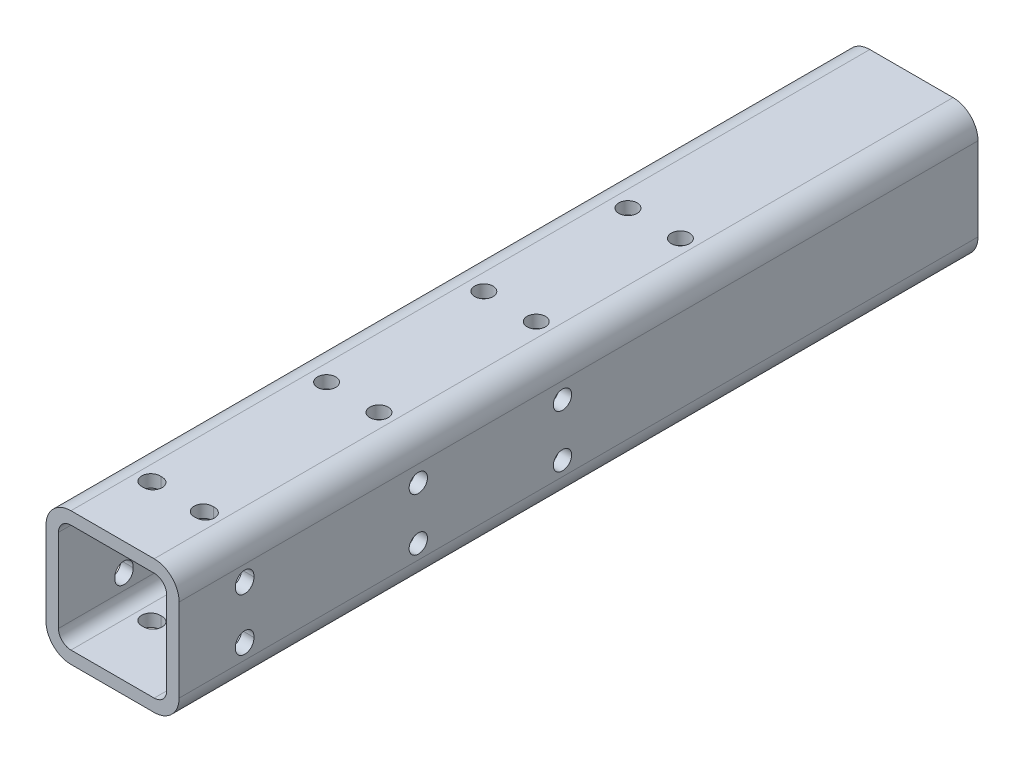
ISO-10303-21;
HEADER;
FILE_DESCRIPTION(('STEP AP214'),'2;1');
FILE_NAME('part.step','',(''),(''),'','','');
FILE_SCHEMA(('AUTOMOTIVE_DESIGN { 1 0 10303 214 1 1 1 1 }'));
ENDSEC;
DATA;
#1=APPLICATION_CONTEXT('core data for automotive mechanical design processes');
#2=APPLICATION_PROTOCOL_DEFINITION('international standard','automotive_design',2000,#1);
#3=PRODUCT_CONTEXT('',#1,'mechanical');
#4=PRODUCT('Part','Part','',(#3));
#5=PRODUCT_RELATED_PRODUCT_CATEGORY('part','',(#4));
#6=PRODUCT_DEFINITION_FORMATION('','',#4);
#7=PRODUCT_DEFINITION_CONTEXT('part definition',#1,'design');
#8=PRODUCT_DEFINITION('design','',#6,#7);
#9=PRODUCT_DEFINITION_SHAPE('','',#8);
#10=(LENGTH_UNIT() NAMED_UNIT(*) SI_UNIT(.MILLI.,.METRE.));
#11=(NAMED_UNIT(*) PLANE_ANGLE_UNIT() SI_UNIT($,.RADIAN.));
#12=(NAMED_UNIT(*) SI_UNIT($,.STERADIAN.) SOLID_ANGLE_UNIT());
#13=UNCERTAINTY_MEASURE_WITH_UNIT(LENGTH_MEASURE(1.E-05),#10,'distance_accuracy_value','');
#14=(GEOMETRIC_REPRESENTATION_CONTEXT(3) GLOBAL_UNCERTAINTY_ASSIGNED_CONTEXT((#13)) GLOBAL_UNIT_ASSIGNED_CONTEXT((#10,
#11,#12)) REPRESENTATION_CONTEXT('',''));
#15=CARTESIAN_POINT('',(0.,0.,0.));
#16=DIRECTION('',(0.,0.,1.));
#17=DIRECTION('',(1.,0.,0.));
#18=AXIS2_PLACEMENT_3D('',#15,#16,#17);
#19=CARTESIAN_POINT('',(9.525,41.275,304.8));
#20=DIRECTION('',(0.,0.,1.));
#21=DIRECTION('',(1.,0.,0.));
#22=AXIS2_PLACEMENT_3D('',#19,#20,#21);
#23=PLANE('',#22);
#24=CARTESIAN_POINT('',(9.525,41.275,304.8));
#25=DIRECTION('',(0.,0.,1.));
#26=DIRECTION('',(1.,0.,0.));
#27=AXIS2_PLACEMENT_3D('',#24,#25,#26);
#28=CIRCLE('',#27,9.525);
#29=CARTESIAN_POINT('',(9.525,50.8,304.8));
#30=VERTEX_POINT('',#29);
#31=CARTESIAN_POINT('',(0.,41.275,304.8));
#32=VERTEX_POINT('',#31);
#33=EDGE_CURVE('E453',#30,#32,#28,.T.);
#34=ORIENTED_EDGE('',*,*,#33,.T.);
#35=DIRECTION('',(0.,-1.,0.));
#36=VECTOR('',#35,1.);
#37=CARTESIAN_POINT('',(0.,9.525,304.8));
#38=LINE('',#37,#36);
#39=CARTESIAN_POINT('',(0.,9.525,304.8));
#40=VERTEX_POINT('',#39);
#41=EDGE_CURVE('E456',#32,#40,#38,.T.);
#42=ORIENTED_EDGE('',*,*,#41,.T.);
#43=CARTESIAN_POINT('',(9.525,9.525,304.8));
#44=DIRECTION('',(0.,0.,1.));
#45=DIRECTION('',(1.,0.,0.));
#46=AXIS2_PLACEMENT_3D('',#43,#44,#45);
#47=CIRCLE('',#46,9.525);
#48=CARTESIAN_POINT('',(9.525,0.,304.8));
#49=VERTEX_POINT('',#48);
#50=EDGE_CURVE('E459',#40,#49,#47,.T.);
#51=ORIENTED_EDGE('',*,*,#50,.T.);
#52=DIRECTION('',(1.,0.,0.));
#53=VECTOR('',#52,1.);
#54=CARTESIAN_POINT('',(41.275,0.,304.8));
#55=LINE('',#54,#53);
#56=CARTESIAN_POINT('',(41.275,0.,304.8));
#57=VERTEX_POINT('',#56);
#58=EDGE_CURVE('E461',#49,#57,#55,.T.);
#59=ORIENTED_EDGE('',*,*,#58,.T.);
#60=CARTESIAN_POINT('',(41.275,9.525,304.8));
#61=DIRECTION('',(0.,0.,1.));
#62=DIRECTION('',(1.,0.,0.));
#63=AXIS2_PLACEMENT_3D('',#60,#61,#62);
#64=CIRCLE('',#63,9.525);
#65=CARTESIAN_POINT('',(50.8,9.525,304.8));
#66=VERTEX_POINT('',#65);
#67=EDGE_CURVE('E463',#57,#66,#64,.T.);
#68=ORIENTED_EDGE('',*,*,#67,.T.);
#69=DIRECTION('',(0.,1.,0.));
#70=VECTOR('',#69,1.);
#71=CARTESIAN_POINT('',(50.8,41.275,304.8));
#72=LINE('',#71,#70);
#73=CARTESIAN_POINT('',(50.8,41.275,304.8));
#74=VERTEX_POINT('',#73);
#75=EDGE_CURVE('E465',#66,#74,#72,.T.);
#76=ORIENTED_EDGE('',*,*,#75,.T.);
#77=CARTESIAN_POINT('',(41.275,41.275,304.8));
#78=DIRECTION('',(0.,0.,1.));
#79=DIRECTION('',(1.,0.,0.));
#80=AXIS2_PLACEMENT_3D('',#77,#78,#79);
#81=CIRCLE('',#80,9.525);
#82=CARTESIAN_POINT('',(41.275,50.8,304.8));
#83=VERTEX_POINT('',#82);
#84=EDGE_CURVE('E467',#74,#83,#81,.T.);
#85=ORIENTED_EDGE('',*,*,#84,.T.);
#86=DIRECTION('',(-1.,0.,0.));
#87=VECTOR('',#86,1.);
#88=CARTESIAN_POINT('',(9.525,50.8,304.8));
#89=LINE('',#88,#87);
#90=EDGE_CURVE('E469',#83,#30,#89,.T.);
#91=ORIENTED_EDGE('',*,*,#90,.T.);
#92=EDGE_LOOP('',(#34,#42,#51,#59,#68,#76,#85,#91));
#93=FACE_BOUND('',#92,.T.);
#94=DIRECTION('',(0.,-1.,0.));
#95=VECTOR('',#94,1.);
#96=CARTESIAN_POINT('',(4.7625,9.525,304.8));
#97=LINE('',#96,#95);
#98=CARTESIAN_POINT('',(4.7625,41.275,304.8));
#99=VERTEX_POINT('',#98);
#100=CARTESIAN_POINT('',(4.7625,9.525,304.8));
#101=VERTEX_POINT('',#100);
#102=EDGE_CURVE('E396',#99,#101,#97,.T.);
#103=ORIENTED_EDGE('',*,*,#102,.F.);
#104=CARTESIAN_POINT('',(9.525,41.275,304.8));
#105=DIRECTION('',(0.,0.,1.));
#106=DIRECTION('',(1.,0.,0.));
#107=AXIS2_PLACEMENT_3D('',#104,#105,#106);
#108=CIRCLE('',#107,4.7625);
#109=CARTESIAN_POINT('',(9.525,46.0375,304.8));
#110=VERTEX_POINT('',#109);
#111=EDGE_CURVE('E394',#110,#99,#108,.T.);
#112=ORIENTED_EDGE('',*,*,#111,.F.);
#113=DIRECTION('',(-1.,0.,0.));
#114=VECTOR('',#113,1.);
#115=CARTESIAN_POINT('',(9.525,46.0375,304.8));
#116=LINE('',#115,#114);
#117=CARTESIAN_POINT('',(41.275,46.0375,304.8));
#118=VERTEX_POINT('',#117);
#119=EDGE_CURVE('E410',#118,#110,#116,.T.);
#120=ORIENTED_EDGE('',*,*,#119,.F.);
#121=CARTESIAN_POINT('',(41.275,41.275,304.8));
#122=DIRECTION('',(0.,0.,1.));
#123=DIRECTION('',(1.,0.,0.));
#124=AXIS2_PLACEMENT_3D('',#121,#122,#123);
#125=CIRCLE('',#124,4.7625);
#126=CARTESIAN_POINT('',(46.0375,41.275,304.8));
#127=VERTEX_POINT('',#126);
#128=EDGE_CURVE('E407',#127,#118,#125,.T.);
#129=ORIENTED_EDGE('',*,*,#128,.F.);
#130=DIRECTION('',(0.,1.,0.));
#131=VECTOR('',#130,1.);
#132=CARTESIAN_POINT('',(46.0375,41.275,304.8));
#133=LINE('',#132,#131);
#134=CARTESIAN_POINT('',(46.0375,9.525,304.8));
#135=VERTEX_POINT('',#134);
#136=EDGE_CURVE('E405',#135,#127,#133,.T.);
#137=ORIENTED_EDGE('',*,*,#136,.F.);
#138=CARTESIAN_POINT('',(41.275,9.525,304.8));
#139=DIRECTION('',(0.,0.,1.));
#140=DIRECTION('',(1.,0.,0.));
#141=AXIS2_PLACEMENT_3D('',#138,#139,#140);
#142=CIRCLE('',#141,4.7625);
#143=CARTESIAN_POINT('',(41.275,4.7625,304.8));
#144=VERTEX_POINT('',#143);
#145=EDGE_CURVE('E403',#144,#135,#142,.T.);
#146=ORIENTED_EDGE('',*,*,#145,.F.);
#147=DIRECTION('',(1.,0.,0.));
#148=VECTOR('',#147,1.);
#149=CARTESIAN_POINT('',(41.275,4.7625,304.8));
#150=LINE('',#149,#148);
#151=CARTESIAN_POINT('',(9.525,4.7625,304.8));
#152=VERTEX_POINT('',#151);
#153=EDGE_CURVE('E401',#152,#144,#150,.T.);
#154=ORIENTED_EDGE('',*,*,#153,.F.);
#155=CARTESIAN_POINT('',(9.525,9.525,304.8));
#156=DIRECTION('',(0.,0.,1.));
#157=DIRECTION('',(1.,0.,0.));
#158=AXIS2_PLACEMENT_3D('',#155,#156,#157);
#159=CIRCLE('',#158,4.7625);
#160=EDGE_CURVE('E399',#101,#152,#159,.T.);
#161=ORIENTED_EDGE('',*,*,#160,.F.);
#162=EDGE_LOOP('',(#103,#112,#120,#129,#137,#146,#154,#161));
#163=FACE_BOUND('',#162,.T.);
#164=ADVANCED_FACE('F40',(#93,#163),#23,.T.);
#165=CARTESIAN_POINT('',(9.525,41.275,0.));
#166=DIRECTION('',(0.,0.,1.));
#167=DIRECTION('',(1.,0.,0.));
#168=AXIS2_PLACEMENT_3D('',#165,#166,#167);
#169=PLANE('',#168);
#170=CARTESIAN_POINT('',(9.525,41.275,0.));
#171=DIRECTION('',(0.,0.,1.));
#172=DIRECTION('',(1.,0.,0.));
#173=AXIS2_PLACEMENT_3D('',#170,#171,#172);
#174=CIRCLE('',#173,9.525);
#175=CARTESIAN_POINT('',(9.525,50.8,0.));
#176=VERTEX_POINT('',#175);
#177=CARTESIAN_POINT('',(0.,41.275,0.));
#178=VERTEX_POINT('',#177);
#179=EDGE_CURVE('E452',#176,#178,#174,.T.);
#180=ORIENTED_EDGE('',*,*,#179,.F.);
#181=DIRECTION('',(-1.,0.,0.));
#182=VECTOR('',#181,1.);
#183=CARTESIAN_POINT('',(9.525,50.8,0.));
#184=LINE('',#183,#182);
#185=CARTESIAN_POINT('',(41.275,50.8,0.));
#186=VERTEX_POINT('',#185);
#187=EDGE_CURVE('E457',#186,#176,#184,.T.);
#188=ORIENTED_EDGE('',*,*,#187,.F.);
#189=CARTESIAN_POINT('',(41.275,41.275,0.));
#190=DIRECTION('',(0.,0.,1.));
#191=DIRECTION('',(1.,0.,0.));
#192=AXIS2_PLACEMENT_3D('',#189,#190,#191);
#193=CIRCLE('',#192,9.525);
#194=CARTESIAN_POINT('',(50.8,41.275,0.));
#195=VERTEX_POINT('',#194);
#196=EDGE_CURVE('E484',#195,#186,#193,.T.);
#197=ORIENTED_EDGE('',*,*,#196,.F.);
#198=DIRECTION('',(0.,1.,0.));
#199=VECTOR('',#198,1.);
#200=CARTESIAN_POINT('',(50.8,41.275,0.));
#201=LINE('',#200,#199);
#202=CARTESIAN_POINT('',(50.8,9.525,0.));
#203=VERTEX_POINT('',#202);
#204=EDGE_CURVE('E482',#203,#195,#201,.T.);
#205=ORIENTED_EDGE('',*,*,#204,.F.);
#206=CARTESIAN_POINT('',(41.275,9.525,0.));
#207=DIRECTION('',(0.,0.,1.));
#208=DIRECTION('',(1.,0.,0.));
#209=AXIS2_PLACEMENT_3D('',#206,#207,#208);
#210=CIRCLE('',#209,9.525);
#211=CARTESIAN_POINT('',(41.275,0.,0.));
#212=VERTEX_POINT('',#211);
#213=EDGE_CURVE('E480',#212,#203,#210,.T.);
#214=ORIENTED_EDGE('',*,*,#213,.F.);
#215=DIRECTION('',(1.,0.,0.));
#216=VECTOR('',#215,1.);
#217=CARTESIAN_POINT('',(41.275,0.,0.));
#218=LINE('',#217,#216);
#219=CARTESIAN_POINT('',(9.525,0.,0.));
#220=VERTEX_POINT('',#219);
#221=EDGE_CURVE('E478',#220,#212,#218,.T.);
#222=ORIENTED_EDGE('',*,*,#221,.F.);
#223=CARTESIAN_POINT('',(9.525,9.525,0.));
#224=DIRECTION('',(0.,0.,1.));
#225=DIRECTION('',(1.,0.,0.));
#226=AXIS2_PLACEMENT_3D('',#223,#224,#225);
#227=CIRCLE('',#226,9.525);
#228=CARTESIAN_POINT('',(0.,9.525,0.));
#229=VERTEX_POINT('',#228);
#230=EDGE_CURVE('E476',#229,#220,#227,.T.);
#231=ORIENTED_EDGE('',*,*,#230,.F.);
#232=DIRECTION('',(0.,-1.,0.));
#233=VECTOR('',#232,1.);
#234=CARTESIAN_POINT('',(0.,9.525,0.));
#235=LINE('',#234,#233);
#236=EDGE_CURVE('E474',#178,#229,#235,.T.);
#237=ORIENTED_EDGE('',*,*,#236,.F.);
#238=EDGE_LOOP('',(#180,#188,#197,#205,#214,#222,#231,#237));
#239=FACE_BOUND('',#238,.T.);
#240=CARTESIAN_POINT('',(9.525,41.275,0.));
#241=DIRECTION('',(0.,0.,1.));
#242=DIRECTION('',(1.,0.,0.));
#243=AXIS2_PLACEMENT_3D('',#240,#241,#242);
#244=CIRCLE('',#243,4.7625);
#245=CARTESIAN_POINT('',(9.525,46.0375,0.));
#246=VERTEX_POINT('',#245);
#247=CARTESIAN_POINT('',(4.7625,41.275,0.));
#248=VERTEX_POINT('',#247);
#249=EDGE_CURVE('E393',#246,#248,#244,.T.);
#250=ORIENTED_EDGE('',*,*,#249,.T.);
#251=DIRECTION('',(0.,-1.,0.));
#252=VECTOR('',#251,1.);
#253=CARTESIAN_POINT('',(4.7625,9.525,0.));
#254=LINE('',#253,#252);
#255=CARTESIAN_POINT('',(4.7625,9.525,0.));
#256=VERTEX_POINT('',#255);
#257=EDGE_CURVE('E415',#248,#256,#254,.T.);
#258=ORIENTED_EDGE('',*,*,#257,.T.);
#259=CARTESIAN_POINT('',(9.525,9.525,0.));
#260=DIRECTION('',(0.,0.,1.));
#261=DIRECTION('',(1.,0.,0.));
#262=AXIS2_PLACEMENT_3D('',#259,#260,#261);
#263=CIRCLE('',#262,4.7625);
#264=CARTESIAN_POINT('',(9.525,4.7625,0.));
#265=VERTEX_POINT('',#264);
#266=EDGE_CURVE('E418',#256,#265,#263,.T.);
#267=ORIENTED_EDGE('',*,*,#266,.T.);
#268=DIRECTION('',(1.,0.,0.));
#269=VECTOR('',#268,1.);
#270=CARTESIAN_POINT('',(41.275,4.7625,0.));
#271=LINE('',#270,#269);
#272=CARTESIAN_POINT('',(41.275,4.7625,0.));
#273=VERTEX_POINT('',#272);
#274=EDGE_CURVE('E421',#265,#273,#271,.T.);
#275=ORIENTED_EDGE('',*,*,#274,.T.);
#276=CARTESIAN_POINT('',(41.275,9.525,0.));
#277=DIRECTION('',(0.,0.,1.));
#278=DIRECTION('',(1.,0.,0.));
#279=AXIS2_PLACEMENT_3D('',#276,#277,#278);
#280=CIRCLE('',#279,4.7625);
#281=CARTESIAN_POINT('',(46.0375,9.525,0.));
#282=VERTEX_POINT('',#281);
#283=EDGE_CURVE('E424',#273,#282,#280,.T.);
#284=ORIENTED_EDGE('',*,*,#283,.T.);
#285=DIRECTION('',(0.,1.,0.));
#286=VECTOR('',#285,1.);
#287=CARTESIAN_POINT('',(46.0375,41.275,0.));
#288=LINE('',#287,#286);
#289=CARTESIAN_POINT('',(46.0375,41.275,0.));
#290=VERTEX_POINT('',#289);
#291=EDGE_CURVE('E427',#282,#290,#288,.T.);
#292=ORIENTED_EDGE('',*,*,#291,.T.);
#293=CARTESIAN_POINT('',(41.275,41.275,0.));
#294=DIRECTION('',(0.,0.,1.));
#295=DIRECTION('',(1.,0.,0.));
#296=AXIS2_PLACEMENT_3D('',#293,#294,#295);
#297=CIRCLE('',#296,4.7625);
#298=CARTESIAN_POINT('',(41.275,46.0375,0.));
#299=VERTEX_POINT('',#298);
#300=EDGE_CURVE('E430',#290,#299,#297,.T.);
#301=ORIENTED_EDGE('',*,*,#300,.T.);
#302=DIRECTION('',(-1.,0.,0.));
#303=VECTOR('',#302,1.);
#304=CARTESIAN_POINT('',(9.525,46.0375,0.));
#305=LINE('',#304,#303);
#306=EDGE_CURVE('E397',#299,#246,#305,.T.);
#307=ORIENTED_EDGE('',*,*,#306,.T.);
#308=EDGE_LOOP('',(#250,#258,#267,#275,#284,#292,#301,#307));
#309=FACE_BOUND('',#308,.T.);
#310=ADVANCED_FACE('F600',(#239,#309),#169,.F.);
#311=CARTESIAN_POINT('',(9.525,41.275,304.8));
#312=DIRECTION('',(0.,0.,-1.));
#313=DIRECTION('',(-1.,0.,0.));
#314=AXIS2_PLACEMENT_3D('',#311,#312,#313);
#315=CYLINDRICAL_SURFACE('',#314,9.525);
#316=ORIENTED_EDGE('',*,*,#179,.T.);
#317=DIRECTION('',(0.,0.,-1.));
#318=VECTOR('',#317,1.);
#319=CARTESIAN_POINT('',(0.,41.275,304.8));
#320=LINE('',#319,#318);
#321=EDGE_CURVE('E507',#32,#178,#320,.T.);
#322=ORIENTED_EDGE('',*,*,#321,.F.);
#323=ORIENTED_EDGE('',*,*,#33,.F.);
#324=DIRECTION('',(0.,0.,-1.));
#325=VECTOR('',#324,1.);
#326=CARTESIAN_POINT('',(9.525,50.8,304.8));
#327=LINE('',#326,#325);
#328=EDGE_CURVE('E471',#30,#176,#327,.T.);
#329=ORIENTED_EDGE('',*,*,#328,.T.);
#330=EDGE_LOOP('',(#316,#322,#323,#329));
#331=FACE_BOUND('',#330,.T.);
#332=ADVANCED_FACE('F42',(#331),#315,.T.);
#333=CARTESIAN_POINT('',(0.,9.525,304.8));
#334=DIRECTION('',(1.,0.,0.));
#335=DIRECTION('',(0.,0.,-1.));
#336=AXIS2_PLACEMENT_3D('',#333,#334,#335);
#337=PLANE('',#336);
#338=CARTESIAN_POINT('',(0.,15.8000000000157,279.799999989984));
#339=DIRECTION('',(-1.,0.,0.));
#340=DIRECTION('',(0.,0.,1.));
#341=AXIS2_PLACEMENT_3D('',#338,#339,#340);
#342=CIRCLE('',#341,3.49999999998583);
#343=CARTESIAN_POINT('',(0.,15.3999999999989,283.277067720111));
#344=VERTEX_POINT('',#343);
#345=CARTESIAN_POINT('',(0.,15.4000000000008,276.322932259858));
#346=VERTEX_POINT('',#345);
#347=EDGE_CURVE('E255',#344,#346,#342,.T.);
#348=ORIENTED_EDGE('',*,*,#347,.F.);
#349=CARTESIAN_POINT('',(0.,14.9999999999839,279.799999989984));
#350=DIRECTION('',(1.,0.,0.));
#351=DIRECTION('',(0.,0.,-1.));
#352=AXIS2_PLACEMENT_3D('',#349,#350,#351);
#353=CIRCLE('',#352,3.49999999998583);
#354=EDGE_CURVE('E251',#344,#346,#353,.T.);
#355=ORIENTED_EDGE('',*,*,#354,.T.);
#356=EDGE_LOOP('',(#348,#355));
#357=FACE_BOUND('',#356,.T.);
#358=CARTESIAN_POINT('',(0.,35.8000000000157,279.799999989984));
#359=DIRECTION('',(-1.,0.,0.));
#360=DIRECTION('',(0.,0.,1.));
#361=AXIS2_PLACEMENT_3D('',#358,#359,#360);
#362=CIRCLE('',#361,3.49999999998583);
#363=CARTESIAN_POINT('',(0.,35.4000000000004,283.277067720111));
#364=VERTEX_POINT('',#363);
#365=CARTESIAN_POINT('',(0.,35.3999999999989,276.322932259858));
#366=VERTEX_POINT('',#365);
#367=EDGE_CURVE('E1100',#364,#366,#362,.T.);
#368=ORIENTED_EDGE('',*,*,#367,.F.);
#369=CARTESIAN_POINT('',(0.,34.9999999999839,279.799999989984));
#370=DIRECTION('',(1.,0.,0.));
#371=DIRECTION('',(0.,0.,-1.));
#372=AXIS2_PLACEMENT_3D('',#369,#370,#371);
#373=CIRCLE('',#372,3.49999999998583);
#374=EDGE_CURVE('E263',#364,#366,#373,.T.);
#375=ORIENTED_EDGE('',*,*,#374,.T.);
#376=EDGE_LOOP('',(#368,#375));
#377=FACE_BOUND('',#376,.T.);
#378=CARTESIAN_POINT('',(0.,34.9999999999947,158.548000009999));
#379=DIRECTION('',(-1.,0.,0.));
#380=DIRECTION('',(0.,0.,1.));
#381=AXIS2_PLACEMENT_3D('',#378,#379,#380);
#382=CIRCLE('',#381,3.49999999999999);
#383=CARTESIAN_POINT('',(0.,34.9999999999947,162.048000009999));
#384=VERTEX_POINT('',#383);
#385=EDGE_CURVE('E353',#384,#384,#382,.T.);
#386=ORIENTED_EDGE('',*,*,#385,.F.);
#387=EDGE_LOOP('',(#386));
#388=FACE_BOUND('',#387,.T.);
#389=CARTESIAN_POINT('',(0.,14.9999999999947,158.548000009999));
#390=DIRECTION('',(-1.,0.,0.));
#391=DIRECTION('',(0.,0.,1.));
#392=AXIS2_PLACEMENT_3D('',#389,#390,#391);
#393=CIRCLE('',#392,3.49999999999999);
#394=CARTESIAN_POINT('',(0.,14.9999999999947,162.048000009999));
#395=VERTEX_POINT('',#394);
#396=EDGE_CURVE('E358',#395,#395,#393,.T.);
#397=ORIENTED_EDGE('',*,*,#396,.F.);
#398=EDGE_LOOP('',(#397));
#399=FACE_BOUND('',#398,.T.);
#400=CARTESIAN_POINT('',(0.,14.9999999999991,213.54800001));
#401=DIRECTION('',(-1.,0.,0.));
#402=DIRECTION('',(0.,0.,1.));
#403=AXIS2_PLACEMENT_3D('',#400,#401,#402);
#404=CIRCLE('',#403,3.49999999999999);
#405=CARTESIAN_POINT('',(0.,14.9999999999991,217.04800001));
#406=VERTEX_POINT('',#405);
#407=EDGE_CURVE('E354',#406,#406,#404,.T.);
#408=ORIENTED_EDGE('',*,*,#407,.F.);
#409=EDGE_LOOP('',(#408));
#410=FACE_BOUND('',#409,.T.);
#411=CARTESIAN_POINT('',(0.,34.9999999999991,213.54800001));
#412=DIRECTION('',(-1.,0.,0.));
#413=DIRECTION('',(0.,0.,1.));
#414=AXIS2_PLACEMENT_3D('',#411,#412,#413);
#415=CIRCLE('',#414,3.49999999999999);
#416=CARTESIAN_POINT('',(0.,34.9999999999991,217.04800001));
#417=VERTEX_POINT('',#416);
#418=EDGE_CURVE('E357',#417,#417,#415,.T.);
#419=ORIENTED_EDGE('',*,*,#418,.F.);
#420=EDGE_LOOP('',(#419));
#421=FACE_BOUND('',#420,.T.);
#422=ORIENTED_EDGE('',*,*,#236,.T.);
#423=DIRECTION('',(0.,0.,-1.));
#424=VECTOR('',#423,1.);
#425=CARTESIAN_POINT('',(0.,9.525,304.8));
#426=LINE('',#425,#424);
#427=EDGE_CURVE('E504',#40,#229,#426,.T.);
#428=ORIENTED_EDGE('',*,*,#427,.F.);
#429=ORIENTED_EDGE('',*,*,#41,.F.);
#430=ORIENTED_EDGE('',*,*,#321,.T.);
#431=EDGE_LOOP('',(#422,#428,#429,#430));
#432=FACE_BOUND('',#431,.T.);
#433=ADVANCED_FACE('F261',(#357,#377,#388,#399,#410,#421,#432),#337,.F.);
#434=CARTESIAN_POINT('',(9.525,9.525,304.8));
#435=DIRECTION('',(0.,0.,-1.));
#436=DIRECTION('',(-1.,0.,0.));
#437=AXIS2_PLACEMENT_3D('',#434,#435,#436);
#438=CYLINDRICAL_SURFACE('',#437,9.525);
#439=ORIENTED_EDGE('',*,*,#230,.T.);
#440=DIRECTION('',(0.,0.,-1.));
#441=VECTOR('',#440,1.);
#442=CARTESIAN_POINT('',(9.525,0.,304.8));
#443=LINE('',#442,#441);
#444=EDGE_CURVE('E501',#49,#220,#443,.T.);
#445=ORIENTED_EDGE('',*,*,#444,.F.);
#446=ORIENTED_EDGE('',*,*,#50,.F.);
#447=ORIENTED_EDGE('',*,*,#427,.T.);
#448=EDGE_LOOP('',(#439,#445,#446,#447));
#449=FACE_BOUND('',#448,.T.);
#450=ADVANCED_FACE('F670',(#449),#438,.T.);
#451=CARTESIAN_POINT('',(41.275,0.,304.8));
#452=DIRECTION('',(0.,1.,0.));
#453=DIRECTION('',(0.,0.,1.));
#454=AXIS2_PLACEMENT_3D('',#451,#452,#453);
#455=PLANE('',#454);
#456=CARTESIAN_POINT('',(35.8000000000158,0.,279.799999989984));
#457=DIRECTION('',(0.,1.,0.));
#458=DIRECTION('',(0.,0.,1.));
#459=AXIS2_PLACEMENT_3D('',#456,#457,#458);
#460=CIRCLE('',#459,3.49999999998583);
#461=CARTESIAN_POINT('',(35.400000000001,0.,283.277067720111));
#462=VERTEX_POINT('',#461);
#463=CARTESIAN_POINT('',(35.399999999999,0.,276.322932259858));
#464=VERTEX_POINT('',#463);
#465=EDGE_CURVE('E290',#462,#464,#460,.T.);
#466=ORIENTED_EDGE('',*,*,#465,.T.);
#467=CARTESIAN_POINT('',(34.9999999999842,0.,279.799999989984));
#468=DIRECTION('',(0.,-1.,0.));
#469=DIRECTION('',(0.,0.,1.));
#470=AXIS2_PLACEMENT_3D('',#467,#468,#469);
#471=CIRCLE('',#470,3.49999999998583);
#472=EDGE_CURVE('E1136',#462,#464,#471,.T.);
#473=ORIENTED_EDGE('',*,*,#472,.F.);
#474=EDGE_LOOP('',(#466,#473));
#475=FACE_BOUND('',#474,.T.);
#476=CARTESIAN_POINT('',(15.8000000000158,0.,279.799999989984));
#477=DIRECTION('',(0.,1.,0.));
#478=DIRECTION('',(0.,0.,1.));
#479=AXIS2_PLACEMENT_3D('',#476,#477,#478);
#480=CIRCLE('',#479,3.49999999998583);
#481=CARTESIAN_POINT('',(15.399999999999,0.,283.277067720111));
#482=VERTEX_POINT('',#481);
#483=CARTESIAN_POINT('',(15.400000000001,0.,276.322932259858));
#484=VERTEX_POINT('',#483);
#485=EDGE_CURVE('E283',#482,#484,#480,.T.);
#486=ORIENTED_EDGE('',*,*,#485,.T.);
#487=CARTESIAN_POINT('',(14.9999999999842,0.,279.799999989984));
#488=DIRECTION('',(0.,-1.,0.));
#489=DIRECTION('',(0.,0.,1.));
#490=AXIS2_PLACEMENT_3D('',#487,#488,#489);
#491=CIRCLE('',#490,3.49999999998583);
#492=EDGE_CURVE('E259',#482,#484,#491,.T.);
#493=ORIENTED_EDGE('',*,*,#492,.F.);
#494=EDGE_LOOP('',(#486,#493));
#495=FACE_BOUND('',#494,.T.);
#496=CARTESIAN_POINT('',(35.8000000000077,0.,213.54800001));
#497=DIRECTION('',(0.,1.,0.));
#498=DIRECTION('',(0.,0.,1.));
#499=AXIS2_PLACEMENT_3D('',#496,#497,#498);
#500=CIRCLE('',#499,3.5);
#501=CARTESIAN_POINT('',(35.8000000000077,0.,217.04800001));
#502=VERTEX_POINT('',#501);
#503=EDGE_CURVE('E350',#502,#502,#500,.T.);
#504=ORIENTED_EDGE('',*,*,#503,.T.);
#505=EDGE_LOOP('',(#504));
#506=FACE_BOUND('',#505,.T.);
#507=CARTESIAN_POINT('',(35.800000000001,0.,153.54799999));
#508=DIRECTION('',(0.,1.,0.));
#509=DIRECTION('',(0.,0.,1.));
#510=AXIS2_PLACEMENT_3D('',#507,#508,#509);
#511=CIRCLE('',#510,3.49999999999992);
#512=CARTESIAN_POINT('',(35.800000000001,0.,157.04799999));
#513=VERTEX_POINT('',#512);
#514=EDGE_CURVE('E343',#513,#513,#511,.T.);
#515=ORIENTED_EDGE('',*,*,#514,.T.);
#516=EDGE_LOOP('',(#515));
#517=FACE_BOUND('',#516,.T.);
#518=CARTESIAN_POINT('',(15.800000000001,0.,153.54799999));
#519=DIRECTION('',(0.,1.,0.));
#520=DIRECTION('',(0.,0.,1.));
#521=AXIS2_PLACEMENT_3D('',#518,#519,#520);
#522=CIRCLE('',#521,3.49999999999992);
#523=CARTESIAN_POINT('',(15.800000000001,0.,157.04799999));
#524=VERTEX_POINT('',#523);
#525=EDGE_CURVE('E336',#524,#524,#522,.T.);
#526=ORIENTED_EDGE('',*,*,#525,.T.);
#527=EDGE_LOOP('',(#526));
#528=FACE_BOUND('',#527,.T.);
#529=CARTESIAN_POINT('',(35.7999999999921,0.,98.5479999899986));
#530=DIRECTION('',(0.,1.,0.));
#531=DIRECTION('',(0.,0.,1.));
#532=AXIS2_PLACEMENT_3D('',#529,#530,#531);
#533=CIRCLE('',#532,3.5);
#534=CARTESIAN_POINT('',(35.7999999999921,0.,102.047999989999));
#535=VERTEX_POINT('',#534);
#536=EDGE_CURVE('E329',#535,#535,#533,.T.);
#537=ORIENTED_EDGE('',*,*,#536,.T.);
#538=EDGE_LOOP('',(#537));
#539=FACE_BOUND('',#538,.T.);
#540=CARTESIAN_POINT('',(15.8000000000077,0.,213.54800001));
#541=DIRECTION('',(0.,1.,0.));
#542=DIRECTION('',(0.,0.,1.));
#543=AXIS2_PLACEMENT_3D('',#540,#541,#542);
#544=CIRCLE('',#543,3.5);
#545=CARTESIAN_POINT('',(15.8000000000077,0.,217.04800001));
#546=VERTEX_POINT('',#545);
#547=EDGE_CURVE('E322',#546,#546,#544,.T.);
#548=ORIENTED_EDGE('',*,*,#547,.T.);
#549=EDGE_LOOP('',(#548));
#550=FACE_BOUND('',#549,.T.);
#551=CARTESIAN_POINT('',(15.7999999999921,0.,98.5479999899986));
#552=DIRECTION('',(0.,1.,0.));
#553=DIRECTION('',(0.,0.,1.));
#554=AXIS2_PLACEMENT_3D('',#551,#552,#553);
#555=CIRCLE('',#554,3.5);
#556=CARTESIAN_POINT('',(15.7999999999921,0.,102.047999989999));
#557=VERTEX_POINT('',#556);
#558=EDGE_CURVE('E315',#557,#557,#555,.T.);
#559=ORIENTED_EDGE('',*,*,#558,.T.);
#560=EDGE_LOOP('',(#559));
#561=FACE_BOUND('',#560,.T.);
#562=ORIENTED_EDGE('',*,*,#221,.T.);
#563=DIRECTION('',(0.,0.,-1.));
#564=VECTOR('',#563,1.);
#565=CARTESIAN_POINT('',(41.275,0.,304.8));
#566=LINE('',#565,#564);
#567=EDGE_CURVE('E498',#57,#212,#566,.T.);
#568=ORIENTED_EDGE('',*,*,#567,.F.);
#569=ORIENTED_EDGE('',*,*,#58,.F.);
#570=ORIENTED_EDGE('',*,*,#444,.T.);
#571=EDGE_LOOP('',(#562,#568,#569,#570));
#572=FACE_BOUND('',#571,.T.);
#573=ADVANCED_FACE('F666',(#475,#495,#506,#517,#528,#539,#550,#561,#572),#455,.F.);
#574=CARTESIAN_POINT('',(41.275,9.525,304.8));
#575=DIRECTION('',(0.,0.,-1.));
#576=DIRECTION('',(-1.,0.,0.));
#577=AXIS2_PLACEMENT_3D('',#574,#575,#576);
#578=CYLINDRICAL_SURFACE('',#577,9.525);
#579=ORIENTED_EDGE('',*,*,#213,.T.);
#580=DIRECTION('',(0.,0.,-1.));
#581=VECTOR('',#580,1.);
#582=CARTESIAN_POINT('',(50.8,9.525,304.8));
#583=LINE('',#582,#581);
#584=EDGE_CURVE('E495',#66,#203,#583,.T.);
#585=ORIENTED_EDGE('',*,*,#584,.F.);
#586=ORIENTED_EDGE('',*,*,#67,.F.);
#587=ORIENTED_EDGE('',*,*,#567,.T.);
#588=EDGE_LOOP('',(#579,#585,#586,#587));
#589=FACE_BOUND('',#588,.T.);
#590=ADVANCED_FACE('F662',(#589),#578,.T.);
#591=CARTESIAN_POINT('',(50.8,41.275,304.8));
#592=DIRECTION('',(-1.,0.,0.));
#593=DIRECTION('',(0.,0.,1.));
#594=AXIS2_PLACEMENT_3D('',#591,#592,#593);
#595=PLANE('',#594);
#596=CARTESIAN_POINT('',(50.7999999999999,34.9999999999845,279.799999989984));
#597=DIRECTION('',(1.,0.,0.));
#598=DIRECTION('',(0.,0.,1.));
#599=AXIS2_PLACEMENT_3D('',#596,#597,#598);
#600=CIRCLE('',#599,3.49999999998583);
#601=CARTESIAN_POINT('',(50.8,35.4000000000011,283.277067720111));
#602=VERTEX_POINT('',#601);
#603=CARTESIAN_POINT('',(50.7999999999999,35.3999999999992,276.322932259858));
#604=VERTEX_POINT('',#603);
#605=EDGE_CURVE('E1137',#602,#604,#600,.T.);
#606=ORIENTED_EDGE('',*,*,#605,.F.);
#607=CARTESIAN_POINT('',(50.8,35.8000000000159,279.799999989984));
#608=DIRECTION('',(-1.,0.,0.));
#609=DIRECTION('',(0.,0.,1.));
#610=AXIS2_PLACEMENT_3D('',#607,#608,#609);
#611=CIRCLE('',#610,3.49999999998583);
#612=EDGE_CURVE('E264',#602,#604,#611,.T.);
#613=ORIENTED_EDGE('',*,*,#612,.T.);
#614=EDGE_LOOP('',(#606,#613));
#615=FACE_BOUND('',#614,.T.);
#616=CARTESIAN_POINT('',(50.8000000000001,14.9999999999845,279.799999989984));
#617=DIRECTION('',(1.,0.,0.));
#618=DIRECTION('',(0.,0.,1.));
#619=AXIS2_PLACEMENT_3D('',#616,#617,#618);
#620=CIRCLE('',#619,3.49999999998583);
#621=CARTESIAN_POINT('',(50.8,15.3999999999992,283.277067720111));
#622=VERTEX_POINT('',#621);
#623=CARTESIAN_POINT('',(50.8000000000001,15.4000000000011,276.322932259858));
#624=VERTEX_POINT('',#623);
#625=EDGE_CURVE('E1132',#622,#624,#620,.T.);
#626=ORIENTED_EDGE('',*,*,#625,.F.);
#627=CARTESIAN_POINT('',(50.8,15.8000000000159,279.799999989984));
#628=DIRECTION('',(-1.,0.,0.));
#629=DIRECTION('',(0.,0.,1.));
#630=AXIS2_PLACEMENT_3D('',#627,#628,#629);
#631=CIRCLE('',#630,3.49999999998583);
#632=EDGE_CURVE('E270',#622,#624,#631,.T.);
#633=ORIENTED_EDGE('',*,*,#632,.T.);
#634=EDGE_LOOP('',(#626,#633));
#635=FACE_BOUND('',#634,.T.);
#636=CARTESIAN_POINT('',(50.8,34.9999999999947,158.548000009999));
#637=DIRECTION('',(-1.,0.,0.));
#638=DIRECTION('',(0.,0.,1.));
#639=AXIS2_PLACEMENT_3D('',#636,#637,#638);
#640=CIRCLE('',#639,3.49999999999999);
#641=CARTESIAN_POINT('',(50.8,34.9999999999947,162.048000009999));
#642=VERTEX_POINT('',#641);
#643=EDGE_CURVE('E390',#642,#642,#640,.T.);
#644=ORIENTED_EDGE('',*,*,#643,.T.);
#645=EDGE_LOOP('',(#644));
#646=FACE_BOUND('',#645,.T.);
#647=CARTESIAN_POINT('',(50.8,14.9999999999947,158.548000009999));
#648=DIRECTION('',(-1.,0.,0.));
#649=DIRECTION('',(0.,0.,1.));
#650=AXIS2_PLACEMENT_3D('',#647,#648,#649);
#651=CIRCLE('',#650,3.49999999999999);
#652=CARTESIAN_POINT('',(50.8,14.9999999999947,162.048000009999));
#653=VERTEX_POINT('',#652);
#654=EDGE_CURVE('E383',#653,#653,#651,.T.);
#655=ORIENTED_EDGE('',*,*,#654,.T.);
#656=EDGE_LOOP('',(#655));
#657=FACE_BOUND('',#656,.T.);
#658=CARTESIAN_POINT('',(50.8,14.9999999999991,213.54800001));
#659=DIRECTION('',(-1.,0.,0.));
#660=DIRECTION('',(0.,0.,1.));
#661=AXIS2_PLACEMENT_3D('',#658,#659,#660);
#662=CIRCLE('',#661,3.49999999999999);
#663=CARTESIAN_POINT('',(50.8,14.9999999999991,217.04800001));
#664=VERTEX_POINT('',#663);
#665=EDGE_CURVE('E376',#664,#664,#662,.T.);
#666=ORIENTED_EDGE('',*,*,#665,.T.);
#667=EDGE_LOOP('',(#666));
#668=FACE_BOUND('',#667,.T.);
#669=CARTESIAN_POINT('',(50.8,34.9999999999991,213.54800001));
#670=DIRECTION('',(-1.,0.,0.));
#671=DIRECTION('',(0.,0.,1.));
#672=AXIS2_PLACEMENT_3D('',#669,#670,#671);
#673=CIRCLE('',#672,3.49999999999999);
#674=CARTESIAN_POINT('',(50.8,34.9999999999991,217.04800001));
#675=VERTEX_POINT('',#674);
#676=EDGE_CURVE('E369',#675,#675,#673,.T.);
#677=ORIENTED_EDGE('',*,*,#676,.T.);
#678=EDGE_LOOP('',(#677));
#679=FACE_BOUND('',#678,.T.);
#680=ORIENTED_EDGE('',*,*,#204,.T.);
#681=DIRECTION('',(0.,0.,-1.));
#682=VECTOR('',#681,1.);
#683=CARTESIAN_POINT('',(50.8,41.275,304.8));
#684=LINE('',#683,#682);
#685=EDGE_CURVE('E492',#74,#195,#684,.T.);
#686=ORIENTED_EDGE('',*,*,#685,.F.);
#687=ORIENTED_EDGE('',*,*,#75,.F.);
#688=ORIENTED_EDGE('',*,*,#584,.T.);
#689=EDGE_LOOP('',(#680,#686,#687,#688));
#690=FACE_BOUND('',#689,.T.);
#691=ADVANCED_FACE('F658',(#615,#635,#646,#657,#668,#679,#690),#595,.F.);
#692=CARTESIAN_POINT('',(41.275,41.275,304.8));
#693=DIRECTION('',(0.,0.,-1.));
#694=DIRECTION('',(-1.,0.,0.));
#695=AXIS2_PLACEMENT_3D('',#692,#693,#694);
#696=CYLINDRICAL_SURFACE('',#695,9.525);
#697=ORIENTED_EDGE('',*,*,#196,.T.);
#698=DIRECTION('',(0.,0.,-1.));
#699=VECTOR('',#698,1.);
#700=CARTESIAN_POINT('',(41.275,50.8,304.8));
#701=LINE('',#700,#699);
#702=EDGE_CURVE('E489',#83,#186,#701,.T.);
#703=ORIENTED_EDGE('',*,*,#702,.F.);
#704=ORIENTED_EDGE('',*,*,#84,.F.);
#705=ORIENTED_EDGE('',*,*,#685,.T.);
#706=EDGE_LOOP('',(#697,#703,#704,#705));
#707=FACE_BOUND('',#706,.T.);
#708=ADVANCED_FACE('F654',(#707),#696,.T.);
#709=CARTESIAN_POINT('',(9.525,50.8,304.8));
#710=DIRECTION('',(0.,-1.,0.));
#711=DIRECTION('',(0.,0.,-1.));
#712=AXIS2_PLACEMENT_3D('',#709,#710,#711);
#713=PLANE('',#712);
#714=CARTESIAN_POINT('',(35.8000000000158,50.8,279.799999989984));
#715=DIRECTION('',(0.,1.,0.));
#716=DIRECTION('',(0.,0.,1.));
#717=AXIS2_PLACEMENT_3D('',#714,#715,#716);
#718=CIRCLE('',#717,3.49999999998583);
#719=CARTESIAN_POINT('',(35.400000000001,50.8,283.277067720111));
#720=VERTEX_POINT('',#719);
#721=CARTESIAN_POINT('',(35.399999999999,50.8,276.322932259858));
#722=VERTEX_POINT('',#721);
#723=EDGE_CURVE('E274',#720,#722,#718,.T.);
#724=ORIENTED_EDGE('',*,*,#723,.F.);
#725=CARTESIAN_POINT('',(34.9999999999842,50.8,279.799999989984));
#726=DIRECTION('',(0.,-1.,0.));
#727=DIRECTION('',(0.,0.,-1.));
#728=AXIS2_PLACEMENT_3D('',#725,#726,#727);
#729=CIRCLE('',#728,3.49999999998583);
#730=EDGE_CURVE('E1119',#720,#722,#729,.T.);
#731=ORIENTED_EDGE('',*,*,#730,.T.);
#732=EDGE_LOOP('',(#724,#731));
#733=FACE_BOUND('',#732,.T.);
#734=CARTESIAN_POINT('',(15.8000000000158,50.8,279.799999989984));
#735=DIRECTION('',(0.,1.,0.));
#736=DIRECTION('',(0.,0.,1.));
#737=AXIS2_PLACEMENT_3D('',#734,#735,#736);
#738=CIRCLE('',#737,3.49999999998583);
#739=CARTESIAN_POINT('',(15.399999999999,50.8,283.277067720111));
#740=VERTEX_POINT('',#739);
#741=CARTESIAN_POINT('',(15.400000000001,50.8,276.322932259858));
#742=VERTEX_POINT('',#741);
#743=EDGE_CURVE('E267',#740,#742,#738,.T.);
#744=ORIENTED_EDGE('',*,*,#743,.F.);
#745=CARTESIAN_POINT('',(14.9999999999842,50.8,279.799999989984));
#746=DIRECTION('',(0.,-1.,0.));
#747=DIRECTION('',(0.,0.,-1.));
#748=AXIS2_PLACEMENT_3D('',#745,#746,#747);
#749=CIRCLE('',#748,3.49999999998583);
#750=EDGE_CURVE('E1124',#740,#742,#749,.T.);
#751=ORIENTED_EDGE('',*,*,#750,.T.);
#752=EDGE_LOOP('',(#744,#751));
#753=FACE_BOUND('',#752,.T.);
#754=CARTESIAN_POINT('',(35.8000000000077,50.8,213.54800001));
#755=DIRECTION('',(0.,1.,0.));
#756=DIRECTION('',(0.,0.,1.));
#757=AXIS2_PLACEMENT_3D('',#754,#755,#756);
#758=CIRCLE('',#757,3.5);
#759=CARTESIAN_POINT('',(35.8000000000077,50.8,217.04800001));
#760=VERTEX_POINT('',#759);
#761=EDGE_CURVE('E296',#760,#760,#758,.T.);
#762=ORIENTED_EDGE('',*,*,#761,.F.);
#763=EDGE_LOOP('',(#762));
#764=FACE_BOUND('',#763,.T.);
#765=CARTESIAN_POINT('',(35.800000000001,50.8,153.54799999));
#766=DIRECTION('',(0.,1.,0.));
#767=DIRECTION('',(0.,0.,1.));
#768=AXIS2_PLACEMENT_3D('',#765,#766,#767);
#769=CIRCLE('',#768,3.49999999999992);
#770=CARTESIAN_POINT('',(35.800000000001,50.8,157.04799999));
#771=VERTEX_POINT('',#770);
#772=EDGE_CURVE('E297',#771,#771,#769,.T.);
#773=ORIENTED_EDGE('',*,*,#772,.F.);
#774=EDGE_LOOP('',(#773));
#775=FACE_BOUND('',#774,.T.);
#776=CARTESIAN_POINT('',(15.800000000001,50.8,153.54799999));
#777=DIRECTION('',(0.,1.,0.));
#778=DIRECTION('',(0.,0.,1.));
#779=AXIS2_PLACEMENT_3D('',#776,#777,#778);
#780=CIRCLE('',#779,3.49999999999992);
#781=CARTESIAN_POINT('',(15.800000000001,50.8,157.04799999));
#782=VERTEX_POINT('',#781);
#783=EDGE_CURVE('E300',#782,#782,#780,.T.);
#784=ORIENTED_EDGE('',*,*,#783,.F.);
#785=EDGE_LOOP('',(#784));
#786=FACE_BOUND('',#785,.T.);
#787=CARTESIAN_POINT('',(35.7999999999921,50.8,98.5479999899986));
#788=DIRECTION('',(0.,1.,0.));
#789=DIRECTION('',(0.,0.,1.));
#790=AXIS2_PLACEMENT_3D('',#787,#788,#789);
#791=CIRCLE('',#790,3.5);
#792=CARTESIAN_POINT('',(35.7999999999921,50.8,102.047999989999));
#793=VERTEX_POINT('',#792);
#794=EDGE_CURVE('E303',#793,#793,#791,.T.);
#795=ORIENTED_EDGE('',*,*,#794,.F.);
#796=EDGE_LOOP('',(#795));
#797=FACE_BOUND('',#796,.T.);
#798=CARTESIAN_POINT('',(15.8000000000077,50.8,213.54800001));
#799=DIRECTION('',(0.,1.,0.));
#800=DIRECTION('',(0.,0.,1.));
#801=AXIS2_PLACEMENT_3D('',#798,#799,#800);
#802=CIRCLE('',#801,3.5);
#803=CARTESIAN_POINT('',(15.8000000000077,50.8,217.04800001));
#804=VERTEX_POINT('',#803);
#805=EDGE_CURVE('E293',#804,#804,#802,.T.);
#806=ORIENTED_EDGE('',*,*,#805,.F.);
#807=EDGE_LOOP('',(#806));
#808=FACE_BOUND('',#807,.T.);
#809=CARTESIAN_POINT('',(15.7999999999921,50.8,98.5479999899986));
#810=DIRECTION('',(0.,1.,0.));
#811=DIRECTION('',(0.,0.,1.));
#812=AXIS2_PLACEMENT_3D('',#809,#810,#811);
#813=CIRCLE('',#812,3.5);
#814=CARTESIAN_POINT('',(15.7999999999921,50.8,102.047999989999));
#815=VERTEX_POINT('',#814);
#816=EDGE_CURVE('E306',#815,#815,#813,.T.);
#817=ORIENTED_EDGE('',*,*,#816,.F.);
#818=EDGE_LOOP('',(#817));
#819=FACE_BOUND('',#818,.T.);
#820=ORIENTED_EDGE('',*,*,#187,.T.);
#821=ORIENTED_EDGE('',*,*,#328,.F.);
#822=ORIENTED_EDGE('',*,*,#90,.F.);
#823=ORIENTED_EDGE('',*,*,#702,.T.);
#824=EDGE_LOOP('',(#820,#821,#822,#823));
#825=FACE_BOUND('',#824,.T.);
#826=ADVANCED_FACE('F651',(#733,#753,#764,#775,#786,#797,#808,#819,#825),#713,.F.);
#827=CARTESIAN_POINT('',(9.525,41.275,304.8));
#828=DIRECTION('',(0.,0.,-1.));
#829=DIRECTION('',(-1.,0.,0.));
#830=AXIS2_PLACEMENT_3D('',#827,#828,#829);
#831=CYLINDRICAL_SURFACE('',#830,4.7625);
#832=ORIENTED_EDGE('',*,*,#249,.F.);
#833=DIRECTION('',(0.,0.,-1.));
#834=VECTOR('',#833,1.);
#835=CARTESIAN_POINT('',(9.525,46.0375,304.8));
#836=LINE('',#835,#834);
#837=EDGE_CURVE('E412',#110,#246,#836,.T.);
#838=ORIENTED_EDGE('',*,*,#837,.F.);
#839=ORIENTED_EDGE('',*,*,#111,.T.);
#840=DIRECTION('',(0.,0.,-1.));
#841=VECTOR('',#840,1.);
#842=CARTESIAN_POINT('',(4.7625,41.275,304.8));
#843=LINE('',#842,#841);
#844=EDGE_CURVE('E449',#99,#248,#843,.T.);
#845=ORIENTED_EDGE('',*,*,#844,.T.);
#846=EDGE_LOOP('',(#832,#838,#839,#845));
#847=FACE_BOUND('',#846,.T.);
#848=ADVANCED_FACE('F579',(#847),#831,.F.);
#849=CARTESIAN_POINT('',(4.7625,9.525,304.8));
#850=DIRECTION('',(1.,0.,0.));
#851=DIRECTION('',(0.,0.,-1.));
#852=AXIS2_PLACEMENT_3D('',#849,#850,#851);
#853=PLANE('',#852);
#854=CARTESIAN_POINT('',(4.7625,14.999999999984,279.799999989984));
#855=DIRECTION('',(1.,0.,0.));
#856=DIRECTION('',(0.,0.,-1.));
#857=AXIS2_PLACEMENT_3D('',#854,#855,#856);
#858=CIRCLE('',#857,3.49999999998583);
#859=CARTESIAN_POINT('',(4.76250000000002,15.3999999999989,283.277067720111));
#860=VERTEX_POINT('',#859);
#861=CARTESIAN_POINT('',(4.76250000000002,15.4000000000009,276.322932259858));
#862=VERTEX_POINT('',#861);
#863=EDGE_CURVE('E11',#860,#862,#858,.T.);
#864=ORIENTED_EDGE('',*,*,#863,.F.);
#865=CARTESIAN_POINT('',(4.76250000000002,15.8000000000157,279.799999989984));
#866=DIRECTION('',(1.,0.,0.));
#867=DIRECTION('',(0.,0.,-1.));
#868=AXIS2_PLACEMENT_3D('',#865,#866,#867);
#869=CIRCLE('',#868,3.49999999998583);
#870=EDGE_CURVE('E48',#862,#860,#869,.T.);
#871=ORIENTED_EDGE('',*,*,#870,.F.);
#872=EDGE_LOOP('',(#864,#871));
#873=FACE_BOUND('',#872,.T.);
#874=CARTESIAN_POINT('',(4.7625,34.999999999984,279.799999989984));
#875=DIRECTION('',(1.,0.,0.));
#876=DIRECTION('',(0.,0.,-1.));
#877=AXIS2_PLACEMENT_3D('',#874,#875,#876);
#878=CIRCLE('',#877,3.49999999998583);
#879=CARTESIAN_POINT('',(4.76250000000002,35.4000000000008,283.277067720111));
#880=VERTEX_POINT('',#879);
#881=CARTESIAN_POINT('',(4.76250000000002,35.3999999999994,276.322932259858));
#882=VERTEX_POINT('',#881);
#883=EDGE_CURVE('E570',#880,#882,#878,.T.);
#884=ORIENTED_EDGE('',*,*,#883,.F.);
#885=CARTESIAN_POINT('',(4.76250000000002,35.8000000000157,279.799999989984));
#886=DIRECTION('',(1.,0.,0.));
#887=DIRECTION('',(0.,0.,-1.));
#888=AXIS2_PLACEMENT_3D('',#885,#886,#887);
#889=CIRCLE('',#888,3.49999999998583);
#890=EDGE_CURVE('E568',#882,#880,#889,.T.);
#891=ORIENTED_EDGE('',*,*,#890,.F.);
#892=EDGE_LOOP('',(#884,#891));
#893=FACE_BOUND('',#892,.T.);
#894=CARTESIAN_POINT('',(4.7625,34.9999999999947,158.548000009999));
#895=DIRECTION('',(1.,0.,0.));
#896=DIRECTION('',(0.,0.,-1.));
#897=AXIS2_PLACEMENT_3D('',#894,#895,#896);
#898=CIRCLE('',#897,3.49999999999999);
#899=CARTESIAN_POINT('',(4.7625,34.9999999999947,155.048000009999));
#900=VERTEX_POINT('',#899);
#901=EDGE_CURVE('E387',#900,#900,#898,.T.);
#902=ORIENTED_EDGE('',*,*,#901,.F.);
#903=EDGE_LOOP('',(#902));
#904=FACE_BOUND('',#903,.T.);
#905=CARTESIAN_POINT('',(4.7625,14.9999999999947,158.548000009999));
#906=DIRECTION('',(1.,0.,0.));
#907=DIRECTION('',(0.,0.,-1.));
#908=AXIS2_PLACEMENT_3D('',#905,#906,#907);
#909=CIRCLE('',#908,3.49999999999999);
#910=CARTESIAN_POINT('',(4.7625,14.9999999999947,155.048000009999));
#911=VERTEX_POINT('',#910);
#912=EDGE_CURVE('E380',#911,#911,#909,.T.);
#913=ORIENTED_EDGE('',*,*,#912,.F.);
#914=EDGE_LOOP('',(#913));
#915=FACE_BOUND('',#914,.T.);
#916=CARTESIAN_POINT('',(4.7625,14.9999999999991,213.54800001));
#917=DIRECTION('',(1.,0.,0.));
#918=DIRECTION('',(0.,0.,-1.));
#919=AXIS2_PLACEMENT_3D('',#916,#917,#918);
#920=CIRCLE('',#919,3.49999999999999);
#921=CARTESIAN_POINT('',(4.7625,14.9999999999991,210.04800001));
#922=VERTEX_POINT('',#921);
#923=EDGE_CURVE('E373',#922,#922,#920,.T.);
#924=ORIENTED_EDGE('',*,*,#923,.F.);
#925=EDGE_LOOP('',(#924));
#926=FACE_BOUND('',#925,.T.);
#927=CARTESIAN_POINT('',(4.7625,34.9999999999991,213.54800001));
#928=DIRECTION('',(1.,0.,0.));
#929=DIRECTION('',(0.,0.,-1.));
#930=AXIS2_PLACEMENT_3D('',#927,#928,#929);
#931=CIRCLE('',#930,3.49999999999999);
#932=CARTESIAN_POINT('',(4.7625,34.9999999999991,210.04800001));
#933=VERTEX_POINT('',#932);
#934=EDGE_CURVE('E366',#933,#933,#931,.T.);
#935=ORIENTED_EDGE('',*,*,#934,.F.);
#936=EDGE_LOOP('',(#935));
#937=FACE_BOUND('',#936,.T.);
#938=ORIENTED_EDGE('',*,*,#257,.F.);
#939=ORIENTED_EDGE('',*,*,#844,.F.);
#940=ORIENTED_EDGE('',*,*,#102,.T.);
#941=DIRECTION('',(0.,0.,-1.));
#942=VECTOR('',#941,1.);
#943=CARTESIAN_POINT('',(4.7625,9.525,304.8));
#944=LINE('',#943,#942);
#945=EDGE_CURVE('E447',#101,#256,#944,.T.);
#946=ORIENTED_EDGE('',*,*,#945,.T.);
#947=EDGE_LOOP('',(#938,#939,#940,#946));
#948=FACE_BOUND('',#947,.T.);
#949=ADVANCED_FACE('F575',(#873,#893,#904,#915,#926,#937,#948),#853,.T.);
#950=CARTESIAN_POINT('',(9.525,9.525,304.8));
#951=DIRECTION('',(0.,0.,-1.));
#952=DIRECTION('',(-1.,0.,0.));
#953=AXIS2_PLACEMENT_3D('',#950,#951,#952);
#954=CYLINDRICAL_SURFACE('',#953,4.7625);
#955=ORIENTED_EDGE('',*,*,#266,.F.);
#956=ORIENTED_EDGE('',*,*,#945,.F.);
#957=ORIENTED_EDGE('',*,*,#160,.T.);
#958=DIRECTION('',(0.,0.,-1.));
#959=VECTOR('',#958,1.);
#960=CARTESIAN_POINT('',(9.525,4.7625,304.8));
#961=LINE('',#960,#959);
#962=EDGE_CURVE('E445',#152,#265,#961,.T.);
#963=ORIENTED_EDGE('',*,*,#962,.T.);
#964=EDGE_LOOP('',(#955,#956,#957,#963));
#965=FACE_BOUND('',#964,.T.);
#966=ADVANCED_FACE('F578',(#965),#954,.F.);
#967=CARTESIAN_POINT('',(41.275,4.7625,304.8));
#968=DIRECTION('',(0.,1.,0.));
#969=DIRECTION('',(0.,0.,1.));
#970=AXIS2_PLACEMENT_3D('',#967,#968,#969);
#971=PLANE('',#970);
#972=CARTESIAN_POINT('',(14.9999999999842,4.76250000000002,279.799999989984));
#973=DIRECTION('',(0.,1.,0.));
#974=DIRECTION('',(0.,0.,1.));
#975=AXIS2_PLACEMENT_3D('',#972,#973,#974);
#976=CIRCLE('',#975,3.49999999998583);
#977=CARTESIAN_POINT('',(15.400000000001,4.76249999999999,276.322932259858));
#978=VERTEX_POINT('',#977);
#979=CARTESIAN_POINT('',(15.399999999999,4.76250000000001,283.277067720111));
#980=VERTEX_POINT('',#979);
#981=EDGE_CURVE('E1115',#978,#980,#976,.T.);
#982=ORIENTED_EDGE('',*,*,#981,.F.);
#983=CARTESIAN_POINT('',(15.8000000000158,4.7625,279.799999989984));
#984=DIRECTION('',(0.,1.,0.));
#985=DIRECTION('',(0.,0.,1.));
#986=AXIS2_PLACEMENT_3D('',#983,#984,#985);
#987=CIRCLE('',#986,3.49999999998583);
#988=EDGE_CURVE('E280',#980,#978,#987,.T.);
#989=ORIENTED_EDGE('',*,*,#988,.F.);
#990=EDGE_LOOP('',(#982,#989));
#991=FACE_BOUND('',#990,.T.);
#992=CARTESIAN_POINT('',(34.9999999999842,4.76250000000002,279.799999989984));
#993=DIRECTION('',(0.,1.,0.));
#994=DIRECTION('',(0.,0.,1.));
#995=AXIS2_PLACEMENT_3D('',#992,#993,#994);
#996=CIRCLE('',#995,3.49999999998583);
#997=CARTESIAN_POINT('',(35.399999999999,4.76249999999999,276.322932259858));
#998=VERTEX_POINT('',#997);
#999=CARTESIAN_POINT('',(35.400000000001,4.76250000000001,283.277067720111));
#1000=VERTEX_POINT('',#999);
#1001=EDGE_CURVE('E1113',#998,#1000,#996,.T.);
#1002=ORIENTED_EDGE('',*,*,#1001,.F.);
#1003=CARTESIAN_POINT('',(35.8000000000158,4.7625,279.799999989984));
#1004=DIRECTION('',(0.,1.,0.));
#1005=DIRECTION('',(0.,0.,1.));
#1006=AXIS2_PLACEMENT_3D('',#1003,#1004,#1005);
#1007=CIRCLE('',#1006,3.49999999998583);
#1008=EDGE_CURVE('E287',#1000,#998,#1007,.T.);
#1009=ORIENTED_EDGE('',*,*,#1008,.F.);
#1010=EDGE_LOOP('',(#1002,#1009));
#1011=FACE_BOUND('',#1010,.T.);
#1012=CARTESIAN_POINT('',(35.8000000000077,4.7625,213.54800001));
#1013=DIRECTION('',(0.,1.,0.));
#1014=DIRECTION('',(0.,0.,1.));
#1015=AXIS2_PLACEMENT_3D('',#1012,#1013,#1014);
#1016=CIRCLE('',#1015,3.5);
#1017=CARTESIAN_POINT('',(35.8000000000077,4.76249999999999,217.04800001));
#1018=VERTEX_POINT('',#1017);
#1019=EDGE_CURVE('E347',#1018,#1018,#1016,.T.);
#1020=ORIENTED_EDGE('',*,*,#1019,.F.);
#1021=EDGE_LOOP('',(#1020));
#1022=FACE_BOUND('',#1021,.T.);
#1023=CARTESIAN_POINT('',(35.800000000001,4.7625,153.54799999));
#1024=DIRECTION('',(0.,1.,0.));
#1025=DIRECTION('',(0.,0.,1.));
#1026=AXIS2_PLACEMENT_3D('',#1023,#1024,#1025);
#1027=CIRCLE('',#1026,3.49999999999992);
#1028=CARTESIAN_POINT('',(35.800000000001,4.76249999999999,157.04799999));
#1029=VERTEX_POINT('',#1028);
#1030=EDGE_CURVE('E340',#1029,#1029,#1027,.T.);
#1031=ORIENTED_EDGE('',*,*,#1030,.F.);
#1032=EDGE_LOOP('',(#1031));
#1033=FACE_BOUND('',#1032,.T.);
#1034=CARTESIAN_POINT('',(15.800000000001,4.7625,153.54799999));
#1035=DIRECTION('',(0.,1.,0.));
#1036=DIRECTION('',(0.,0.,1.));
#1037=AXIS2_PLACEMENT_3D('',#1034,#1035,#1036);
#1038=CIRCLE('',#1037,3.49999999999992);
#1039=CARTESIAN_POINT('',(15.800000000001,4.76249999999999,157.04799999));
#1040=VERTEX_POINT('',#1039);
#1041=EDGE_CURVE('E333',#1040,#1040,#1038,.T.);
#1042=ORIENTED_EDGE('',*,*,#1041,.F.);
#1043=EDGE_LOOP('',(#1042));
#1044=FACE_BOUND('',#1043,.T.);
#1045=CARTESIAN_POINT('',(35.7999999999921,4.7625,98.5479999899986));
#1046=DIRECTION('',(0.,1.,0.));
#1047=DIRECTION('',(0.,0.,1.));
#1048=AXIS2_PLACEMENT_3D('',#1045,#1046,#1047);
#1049=CIRCLE('',#1048,3.5);
#1050=CARTESIAN_POINT('',(35.7999999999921,4.76249999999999,102.047999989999));
#1051=VERTEX_POINT('',#1050);
#1052=EDGE_CURVE('E326',#1051,#1051,#1049,.T.);
#1053=ORIENTED_EDGE('',*,*,#1052,.F.);
#1054=EDGE_LOOP('',(#1053));
#1055=FACE_BOUND('',#1054,.T.);
#1056=CARTESIAN_POINT('',(15.8000000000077,4.7625,213.54800001));
#1057=DIRECTION('',(0.,1.,0.));
#1058=DIRECTION('',(0.,0.,1.));
#1059=AXIS2_PLACEMENT_3D('',#1056,#1057,#1058);
#1060=CIRCLE('',#1059,3.5);
#1061=CARTESIAN_POINT('',(15.8000000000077,4.76249999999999,217.04800001));
#1062=VERTEX_POINT('',#1061);
#1063=EDGE_CURVE('E319',#1062,#1062,#1060,.T.);
#1064=ORIENTED_EDGE('',*,*,#1063,.F.);
#1065=EDGE_LOOP('',(#1064));
#1066=FACE_BOUND('',#1065,.T.);
#1067=CARTESIAN_POINT('',(15.7999999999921,4.7625,98.5479999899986));
#1068=DIRECTION('',(0.,1.,0.));
#1069=DIRECTION('',(0.,0.,1.));
#1070=AXIS2_PLACEMENT_3D('',#1067,#1068,#1069);
#1071=CIRCLE('',#1070,3.5);
#1072=CARTESIAN_POINT('',(15.7999999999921,4.76249999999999,102.047999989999));
#1073=VERTEX_POINT('',#1072);
#1074=EDGE_CURVE('E312',#1073,#1073,#1071,.T.);
#1075=ORIENTED_EDGE('',*,*,#1074,.F.);
#1076=EDGE_LOOP('',(#1075));
#1077=FACE_BOUND('',#1076,.T.);
#1078=ORIENTED_EDGE('',*,*,#274,.F.);
#1079=ORIENTED_EDGE('',*,*,#962,.F.);
#1080=ORIENTED_EDGE('',*,*,#153,.T.);
#1081=DIRECTION('',(0.,0.,-1.));
#1082=VECTOR('',#1081,1.);
#1083=CARTESIAN_POINT('',(41.275,4.7625,304.8));
#1084=LINE('',#1083,#1082);
#1085=EDGE_CURVE('E443',#144,#273,#1084,.T.);
#1086=ORIENTED_EDGE('',*,*,#1085,.T.);
#1087=EDGE_LOOP('',(#1078,#1079,#1080,#1086));
#1088=FACE_BOUND('',#1087,.T.);
#1089=ADVANCED_FACE('F615',(#991,#1011,#1022,#1033,#1044,#1055,#1066,#1077,#1088),#971,.T.);
#1090=CARTESIAN_POINT('',(41.275,9.525,304.8));
#1091=DIRECTION('',(0.,0.,-1.));
#1092=DIRECTION('',(-1.,0.,0.));
#1093=AXIS2_PLACEMENT_3D('',#1090,#1091,#1092);
#1094=CYLINDRICAL_SURFACE('',#1093,4.7625);
#1095=ORIENTED_EDGE('',*,*,#283,.F.);
#1096=ORIENTED_EDGE('',*,*,#1085,.F.);
#1097=ORIENTED_EDGE('',*,*,#145,.T.);
#1098=DIRECTION('',(0.,0.,-1.));
#1099=VECTOR('',#1098,1.);
#1100=CARTESIAN_POINT('',(46.0375,9.525,304.8));
#1101=LINE('',#1100,#1099);
#1102=EDGE_CURVE('E441',#135,#282,#1101,.T.);
#1103=ORIENTED_EDGE('',*,*,#1102,.T.);
#1104=EDGE_LOOP('',(#1095,#1096,#1097,#1103));
#1105=FACE_BOUND('',#1104,.T.);
#1106=ADVANCED_FACE('F619',(#1105),#1094,.F.);
#1107=CARTESIAN_POINT('',(46.0375,41.275,304.8));
#1108=DIRECTION('',(-1.,0.,0.));
#1109=DIRECTION('',(0.,0.,1.));
#1110=AXIS2_PLACEMENT_3D('',#1107,#1108,#1109);
#1111=PLANE('',#1110);
#1112=CARTESIAN_POINT('',(46.0375,35.8000000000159,279.799999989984));
#1113=DIRECTION('',(-1.,0.,0.));
#1114=DIRECTION('',(0.,0.,1.));
#1115=AXIS2_PLACEMENT_3D('',#1112,#1113,#1114);
#1116=CIRCLE('',#1115,3.49999999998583);
#1117=CARTESIAN_POINT('',(46.0375,35.4000000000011,283.277067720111));
#1118=VERTEX_POINT('',#1117);
#1119=CARTESIAN_POINT('',(46.0375,35.3999999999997,276.322932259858));
#1120=VERTEX_POINT('',#1119);
#1121=EDGE_CURVE('E565',#1118,#1120,#1116,.T.);
#1122=ORIENTED_EDGE('',*,*,#1121,.F.);
#1123=CARTESIAN_POINT('',(46.0375,34.9999999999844,279.799999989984));
#1124=DIRECTION('',(-1.,0.,0.));
#1125=DIRECTION('',(0.,0.,1.));
#1126=AXIS2_PLACEMENT_3D('',#1123,#1124,#1125);
#1127=CIRCLE('',#1126,3.49999999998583);
#1128=EDGE_CURVE('E563',#1120,#1118,#1127,.T.);
#1129=ORIENTED_EDGE('',*,*,#1128,.F.);
#1130=EDGE_LOOP('',(#1122,#1129));
#1131=FACE_BOUND('',#1130,.T.);
#1132=CARTESIAN_POINT('',(46.0375,15.8000000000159,279.799999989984));
#1133=DIRECTION('',(-1.,0.,0.));
#1134=DIRECTION('',(0.,0.,1.));
#1135=AXIS2_PLACEMENT_3D('',#1132,#1133,#1134);
#1136=CIRCLE('',#1135,3.49999999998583);
#1137=CARTESIAN_POINT('',(46.0375,15.3999999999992,283.277067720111));
#1138=VERTEX_POINT('',#1137);
#1139=CARTESIAN_POINT('',(46.0375,15.4000000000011,276.322932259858));
#1140=VERTEX_POINT('',#1139);
#1141=EDGE_CURVE('E560',#1138,#1140,#1136,.T.);
#1142=ORIENTED_EDGE('',*,*,#1141,.F.);
#1143=CARTESIAN_POINT('',(46.0375,14.9999999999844,279.799999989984));
#1144=DIRECTION('',(-1.,0.,0.));
#1145=DIRECTION('',(0.,0.,1.));
#1146=AXIS2_PLACEMENT_3D('',#1143,#1144,#1145);
#1147=CIRCLE('',#1146,3.49999999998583);
#1148=EDGE_CURVE('E558',#1140,#1138,#1147,.T.);
#1149=ORIENTED_EDGE('',*,*,#1148,.F.);
#1150=EDGE_LOOP('',(#1142,#1149));
#1151=FACE_BOUND('',#1150,.T.);
#1152=CARTESIAN_POINT('',(46.0375,34.9999999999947,158.548000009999));
#1153=DIRECTION('',(-1.,0.,0.));
#1154=DIRECTION('',(0.,0.,1.));
#1155=AXIS2_PLACEMENT_3D('',#1152,#1153,#1154);
#1156=CIRCLE('',#1155,3.49999999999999);
#1157=CARTESIAN_POINT('',(46.0375,34.9999999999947,162.048000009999));
#1158=VERTEX_POINT('',#1157);
#1159=EDGE_CURVE('E386',#1158,#1158,#1156,.T.);
#1160=ORIENTED_EDGE('',*,*,#1159,.F.);
#1161=EDGE_LOOP('',(#1160));
#1162=FACE_BOUND('',#1161,.T.);
#1163=CARTESIAN_POINT('',(46.0375,14.9999999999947,158.548000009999));
#1164=DIRECTION('',(-1.,0.,0.));
#1165=DIRECTION('',(0.,0.,1.));
#1166=AXIS2_PLACEMENT_3D('',#1163,#1164,#1165);
#1167=CIRCLE('',#1166,3.49999999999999);
#1168=CARTESIAN_POINT('',(46.0375,14.9999999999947,162.048000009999));
#1169=VERTEX_POINT('',#1168);
#1170=EDGE_CURVE('E379',#1169,#1169,#1167,.T.);
#1171=ORIENTED_EDGE('',*,*,#1170,.F.);
#1172=EDGE_LOOP('',(#1171));
#1173=FACE_BOUND('',#1172,.T.);
#1174=CARTESIAN_POINT('',(46.0375,14.9999999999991,213.54800001));
#1175=DIRECTION('',(-1.,0.,0.));
#1176=DIRECTION('',(0.,0.,1.));
#1177=AXIS2_PLACEMENT_3D('',#1174,#1175,#1176);
#1178=CIRCLE('',#1177,3.49999999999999);
#1179=CARTESIAN_POINT('',(46.0375,14.9999999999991,217.04800001));
#1180=VERTEX_POINT('',#1179);
#1181=EDGE_CURVE('E372',#1180,#1180,#1178,.T.);
#1182=ORIENTED_EDGE('',*,*,#1181,.F.);
#1183=EDGE_LOOP('',(#1182));
#1184=FACE_BOUND('',#1183,.T.);
#1185=CARTESIAN_POINT('',(46.0375,34.9999999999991,213.54800001));
#1186=DIRECTION('',(-1.,0.,0.));
#1187=DIRECTION('',(0.,0.,1.));
#1188=AXIS2_PLACEMENT_3D('',#1185,#1186,#1187);
#1189=CIRCLE('',#1188,3.49999999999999);
#1190=CARTESIAN_POINT('',(46.0375,34.9999999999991,217.04800001));
#1191=VERTEX_POINT('',#1190);
#1192=EDGE_CURVE('E365',#1191,#1191,#1189,.T.);
#1193=ORIENTED_EDGE('',*,*,#1192,.F.);
#1194=EDGE_LOOP('',(#1193));
#1195=FACE_BOUND('',#1194,.T.);
#1196=ORIENTED_EDGE('',*,*,#291,.F.);
#1197=ORIENTED_EDGE('',*,*,#1102,.F.);
#1198=ORIENTED_EDGE('',*,*,#136,.T.);
#1199=DIRECTION('',(0.,0.,-1.));
#1200=VECTOR('',#1199,1.);
#1201=CARTESIAN_POINT('',(46.0375,41.275,304.8));
#1202=LINE('',#1201,#1200);
#1203=EDGE_CURVE('E439',#127,#290,#1202,.T.);
#1204=ORIENTED_EDGE('',*,*,#1203,.T.);
#1205=EDGE_LOOP('',(#1196,#1197,#1198,#1204));
#1206=FACE_BOUND('',#1205,.T.);
#1207=ADVANCED_FACE('F624',(#1131,#1151,#1162,#1173,#1184,#1195,#1206),#1111,.T.);
#1208=CARTESIAN_POINT('',(41.275,41.275,304.8));
#1209=DIRECTION('',(0.,0.,-1.));
#1210=DIRECTION('',(-1.,0.,0.));
#1211=AXIS2_PLACEMENT_3D('',#1208,#1209,#1210);
#1212=CYLINDRICAL_SURFACE('',#1211,4.7625);
#1213=ORIENTED_EDGE('',*,*,#300,.F.);
#1214=ORIENTED_EDGE('',*,*,#1203,.F.);
#1215=ORIENTED_EDGE('',*,*,#128,.T.);
#1216=DIRECTION('',(0.,0.,-1.));
#1217=VECTOR('',#1216,1.);
#1218=CARTESIAN_POINT('',(41.275,46.0375,304.8));
#1219=LINE('',#1218,#1217);
#1220=EDGE_CURVE('E437',#118,#299,#1219,.T.);
#1221=ORIENTED_EDGE('',*,*,#1220,.T.);
#1222=EDGE_LOOP('',(#1213,#1214,#1215,#1221));
#1223=FACE_BOUND('',#1222,.T.);
#1224=ADVANCED_FACE('F627',(#1223),#1212,.F.);
#1225=CARTESIAN_POINT('',(9.525,46.0375,304.8));
#1226=DIRECTION('',(0.,-1.,0.));
#1227=DIRECTION('',(0.,0.,-1.));
#1228=AXIS2_PLACEMENT_3D('',#1225,#1226,#1227);
#1229=PLANE('',#1228);
#1230=CARTESIAN_POINT('',(14.9999999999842,46.0375,279.799999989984));
#1231=DIRECTION('',(0.,-1.,0.));
#1232=DIRECTION('',(0.,0.,-1.));
#1233=AXIS2_PLACEMENT_3D('',#1230,#1231,#1232);
#1234=CIRCLE('',#1233,3.49999999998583);
#1235=CARTESIAN_POINT('',(15.399999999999,46.0375,283.277067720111));
#1236=VERTEX_POINT('',#1235);
#1237=CARTESIAN_POINT('',(15.400000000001,46.0375,276.322932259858));
#1238=VERTEX_POINT('',#1237);
#1239=EDGE_CURVE('E1122',#1236,#1238,#1234,.T.);
#1240=ORIENTED_EDGE('',*,*,#1239,.F.);
#1241=CARTESIAN_POINT('',(15.8000000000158,46.0375,279.799999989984));
#1242=DIRECTION('',(0.,-1.,0.));
#1243=DIRECTION('',(0.,0.,-1.));
#1244=AXIS2_PLACEMENT_3D('',#1241,#1242,#1243);
#1245=CIRCLE('',#1244,3.49999999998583);
#1246=EDGE_CURVE('E277',#1238,#1236,#1245,.T.);
#1247=ORIENTED_EDGE('',*,*,#1246,.F.);
#1248=EDGE_LOOP('',(#1240,#1247));
#1249=FACE_BOUND('',#1248,.T.);
#1250=CARTESIAN_POINT('',(34.9999999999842,46.0375,279.799999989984));
#1251=DIRECTION('',(0.,-1.,0.));
#1252=DIRECTION('',(0.,0.,-1.));
#1253=AXIS2_PLACEMENT_3D('',#1250,#1251,#1252);
#1254=CIRCLE('',#1253,3.49999999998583);
#1255=CARTESIAN_POINT('',(35.400000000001,46.0375,283.277067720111));
#1256=VERTEX_POINT('',#1255);
#1257=CARTESIAN_POINT('',(35.399999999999,46.0375,276.322932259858));
#1258=VERTEX_POINT('',#1257);
#1259=EDGE_CURVE('E1117',#1256,#1258,#1254,.T.);
#1260=ORIENTED_EDGE('',*,*,#1259,.F.);
#1261=CARTESIAN_POINT('',(35.8000000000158,46.0375,279.799999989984));
#1262=DIRECTION('',(0.,-1.,0.));
#1263=DIRECTION('',(0.,0.,-1.));
#1264=AXIS2_PLACEMENT_3D('',#1261,#1262,#1263);
#1265=CIRCLE('',#1264,3.49999999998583);
#1266=EDGE_CURVE('E286',#1258,#1256,#1265,.T.);
#1267=ORIENTED_EDGE('',*,*,#1266,.F.);
#1268=EDGE_LOOP('',(#1260,#1267));
#1269=FACE_BOUND('',#1268,.T.);
#1270=CARTESIAN_POINT('',(35.8000000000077,46.0375,213.54800001));
#1271=DIRECTION('',(0.,-1.,0.));
#1272=DIRECTION('',(0.,0.,-1.));
#1273=AXIS2_PLACEMENT_3D('',#1270,#1271,#1272);
#1274=CIRCLE('',#1273,3.5);
#1275=CARTESIAN_POINT('',(35.8000000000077,46.0375,210.04800001));
#1276=VERTEX_POINT('',#1275);
#1277=EDGE_CURVE('E346',#1276,#1276,#1274,.T.);
#1278=ORIENTED_EDGE('',*,*,#1277,.F.);
#1279=EDGE_LOOP('',(#1278));
#1280=FACE_BOUND('',#1279,.T.);
#1281=CARTESIAN_POINT('',(35.800000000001,46.0375,153.54799999));
#1282=DIRECTION('',(0.,-1.,0.));
#1283=DIRECTION('',(0.,0.,-1.));
#1284=AXIS2_PLACEMENT_3D('',#1281,#1282,#1283);
#1285=CIRCLE('',#1284,3.49999999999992);
#1286=CARTESIAN_POINT('',(35.800000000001,46.0375,150.04799999));
#1287=VERTEX_POINT('',#1286);
#1288=EDGE_CURVE('E339',#1287,#1287,#1285,.T.);
#1289=ORIENTED_EDGE('',*,*,#1288,.F.);
#1290=EDGE_LOOP('',(#1289));
#1291=FACE_BOUND('',#1290,.T.);
#1292=CARTESIAN_POINT('',(15.800000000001,46.0375,153.54799999));
#1293=DIRECTION('',(0.,-1.,0.));
#1294=DIRECTION('',(0.,0.,-1.));
#1295=AXIS2_PLACEMENT_3D('',#1292,#1293,#1294);
#1296=CIRCLE('',#1295,3.49999999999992);
#1297=CARTESIAN_POINT('',(15.800000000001,46.0375,150.04799999));
#1298=VERTEX_POINT('',#1297);
#1299=EDGE_CURVE('E332',#1298,#1298,#1296,.T.);
#1300=ORIENTED_EDGE('',*,*,#1299,.F.);
#1301=EDGE_LOOP('',(#1300));
#1302=FACE_BOUND('',#1301,.T.);
#1303=CARTESIAN_POINT('',(35.7999999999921,46.0375,98.5479999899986));
#1304=DIRECTION('',(0.,-1.,0.));
#1305=DIRECTION('',(0.,0.,-1.));
#1306=AXIS2_PLACEMENT_3D('',#1303,#1304,#1305);
#1307=CIRCLE('',#1306,3.5);
#1308=CARTESIAN_POINT('',(35.7999999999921,46.0375,95.0479999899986));
#1309=VERTEX_POINT('',#1308);
#1310=EDGE_CURVE('E325',#1309,#1309,#1307,.T.);
#1311=ORIENTED_EDGE('',*,*,#1310,.F.);
#1312=EDGE_LOOP('',(#1311));
#1313=FACE_BOUND('',#1312,.T.);
#1314=CARTESIAN_POINT('',(15.8000000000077,46.0375,213.54800001));
#1315=DIRECTION('',(0.,-1.,0.));
#1316=DIRECTION('',(0.,0.,-1.));
#1317=AXIS2_PLACEMENT_3D('',#1314,#1315,#1316);
#1318=CIRCLE('',#1317,3.5);
#1319=CARTESIAN_POINT('',(15.8000000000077,46.0375,210.04800001));
#1320=VERTEX_POINT('',#1319);
#1321=EDGE_CURVE('E318',#1320,#1320,#1318,.T.);
#1322=ORIENTED_EDGE('',*,*,#1321,.F.);
#1323=EDGE_LOOP('',(#1322));
#1324=FACE_BOUND('',#1323,.T.);
#1325=CARTESIAN_POINT('',(15.7999999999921,46.0375,98.5479999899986));
#1326=DIRECTION('',(0.,-1.,0.));
#1327=DIRECTION('',(0.,0.,-1.));
#1328=AXIS2_PLACEMENT_3D('',#1325,#1326,#1327);
#1329=CIRCLE('',#1328,3.5);
#1330=CARTESIAN_POINT('',(15.7999999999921,46.0375,95.0479999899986));
#1331=VERTEX_POINT('',#1330);
#1332=EDGE_CURVE('E311',#1331,#1331,#1329,.T.);
#1333=ORIENTED_EDGE('',*,*,#1332,.F.);
#1334=EDGE_LOOP('',(#1333));
#1335=FACE_BOUND('',#1334,.T.);
#1336=ORIENTED_EDGE('',*,*,#306,.F.);
#1337=ORIENTED_EDGE('',*,*,#1220,.F.);
#1338=ORIENTED_EDGE('',*,*,#119,.T.);
#1339=ORIENTED_EDGE('',*,*,#837,.T.);
#1340=EDGE_LOOP('',(#1336,#1337,#1338,#1339));
#1341=FACE_BOUND('',#1340,.T.);
#1342=ADVANCED_FACE('F604',(#1249,#1269,#1280,#1291,#1302,#1313,#1324,#1335,#1341),#1229,.T.);
#1343=CARTESIAN_POINT('',(178.054,34.9999999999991,213.54800001));
#1344=DIRECTION('',(-1.,0.,0.));
#1345=DIRECTION('',(0.,0.,1.));
#1346=AXIS2_PLACEMENT_3D('',#1343,#1344,#1345);
#1347=CYLINDRICAL_SURFACE('',#1346,3.49999999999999);
#1348=CARTESIAN_POINT('',(46.0375,34.9999999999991,217.04800001));
#1349=CARTESIAN_POINT('',(46.087109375,34.9999999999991,217.04800001));
#1350=CARTESIAN_POINT('',(46.13671875,34.9999999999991,217.04800001));
#1351=CARTESIAN_POINT('',(46.2359375,34.9999999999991,217.04800001));
#1352=CARTESIAN_POINT('',(46.285546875,34.9999999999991,217.04800001));
#1353=CARTESIAN_POINT('',(46.384765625,34.9999999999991,217.04800001));
#1354=CARTESIAN_POINT('',(46.434375,34.9999999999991,217.04800001));
#1355=CARTESIAN_POINT('',(46.53359375,34.9999999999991,217.04800001));
#1356=CARTESIAN_POINT('',(46.583203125,34.9999999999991,217.04800001));
#1357=CARTESIAN_POINT('',(46.682421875,34.9999999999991,217.04800001));
#1358=CARTESIAN_POINT('',(46.73203125,34.9999999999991,217.04800001));
#1359=CARTESIAN_POINT('',(46.83125,34.9999999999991,217.04800001));
#1360=CARTESIAN_POINT('',(46.880859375,34.9999999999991,217.04800001));
#1361=CARTESIAN_POINT('',(46.980078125,34.9999999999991,217.04800001));
#1362=CARTESIAN_POINT('',(47.0296875,34.9999999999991,217.04800001));
#1363=CARTESIAN_POINT('',(47.12890625,34.9999999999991,217.04800001));
#1364=CARTESIAN_POINT('',(47.178515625,34.9999999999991,217.04800001));
#1365=CARTESIAN_POINT('',(47.277734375,34.9999999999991,217.04800001));
#1366=CARTESIAN_POINT('',(47.32734375,34.9999999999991,217.04800001));
#1367=CARTESIAN_POINT('',(47.4265625,34.9999999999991,217.04800001));
#1368=CARTESIAN_POINT('',(47.476171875,34.9999999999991,217.04800001));
#1369=CARTESIAN_POINT('',(47.575390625,34.9999999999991,217.04800001));
#1370=CARTESIAN_POINT('',(47.625,34.9999999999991,217.04800001));
#1371=CARTESIAN_POINT('',(47.72421875,34.9999999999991,217.04800001));
#1372=CARTESIAN_POINT('',(47.773828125,34.9999999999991,217.04800001));
#1373=CARTESIAN_POINT('',(47.873046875,34.9999999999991,217.04800001));
#1374=CARTESIAN_POINT('',(47.92265625,34.9999999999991,217.04800001));
#1375=CARTESIAN_POINT('',(48.021875,34.9999999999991,217.04800001));
#1376=CARTESIAN_POINT('',(48.071484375,34.9999999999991,217.04800001));
#1377=CARTESIAN_POINT('',(48.170703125,34.9999999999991,217.04800001));
#1378=CARTESIAN_POINT('',(48.2203125,34.9999999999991,217.04800001));
#1379=CARTESIAN_POINT('',(48.31953125,34.9999999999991,217.04800001));
#1380=CARTESIAN_POINT('',(48.369140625,34.9999999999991,217.04800001));
#1381=CARTESIAN_POINT('',(48.468359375,34.9999999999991,217.04800001));
#1382=CARTESIAN_POINT('',(48.51796875,34.9999999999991,217.04800001));
#1383=CARTESIAN_POINT('',(48.6171875,34.9999999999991,217.04800001));
#1384=CARTESIAN_POINT('',(48.666796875,34.9999999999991,217.04800001));
#1385=CARTESIAN_POINT('',(48.766015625,34.9999999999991,217.04800001));
#1386=CARTESIAN_POINT('',(48.815625,34.9999999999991,217.04800001));
#1387=CARTESIAN_POINT('',(48.91484375,34.9999999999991,217.04800001));
#1388=CARTESIAN_POINT('',(48.964453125,34.9999999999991,217.04800001));
#1389=CARTESIAN_POINT('',(49.063671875,34.9999999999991,217.04800001));
#1390=CARTESIAN_POINT('',(49.11328125,34.9999999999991,217.04800001));
#1391=CARTESIAN_POINT('',(49.2125,34.9999999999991,217.04800001));
#1392=CARTESIAN_POINT('',(49.262109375,34.9999999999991,217.04800001));
#1393=CARTESIAN_POINT('',(49.361328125,34.9999999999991,217.04800001));
#1394=CARTESIAN_POINT('',(49.4109375,34.9999999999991,217.04800001));
#1395=CARTESIAN_POINT('',(49.51015625,34.9999999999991,217.04800001));
#1396=CARTESIAN_POINT('',(49.559765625,34.9999999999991,217.04800001));
#1397=CARTESIAN_POINT('',(49.658984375,34.9999999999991,217.04800001));
#1398=CARTESIAN_POINT('',(49.70859375,34.9999999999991,217.04800001));
#1399=CARTESIAN_POINT('',(49.8078125,34.9999999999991,217.04800001));
#1400=CARTESIAN_POINT('',(49.857421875,34.9999999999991,217.04800001));
#1401=CARTESIAN_POINT('',(49.956640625,34.9999999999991,217.04800001));
#1402=CARTESIAN_POINT('',(50.00625,34.9999999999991,217.04800001));
#1403=CARTESIAN_POINT('',(50.10546875,34.9999999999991,217.04800001));
#1404=CARTESIAN_POINT('',(50.155078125,34.9999999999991,217.04800001));
#1405=CARTESIAN_POINT('',(50.254296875,34.9999999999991,217.04800001));
#1406=CARTESIAN_POINT('',(50.30390625,34.9999999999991,217.04800001));
#1407=CARTESIAN_POINT('',(50.403125,34.9999999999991,217.04800001));
#1408=CARTESIAN_POINT('',(50.452734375,34.9999999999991,217.04800001));
#1409=CARTESIAN_POINT('',(50.551953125,34.9999999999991,217.04800001));
#1410=CARTESIAN_POINT('',(50.6015625,34.9999999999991,217.04800001));
#1411=CARTESIAN_POINT('',(50.70078125,34.9999999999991,217.04800001));
#1412=CARTESIAN_POINT('',(50.750390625,34.9999999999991,217.04800001));
#1413=CARTESIAN_POINT('',(50.8,34.9999999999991,217.04800001));
#1414=B_SPLINE_CURVE_WITH_KNOTS('',3,(#1348,#1349,#1350,#1351,#1352,#1353,#1354,#1355,#1356,
#1357,#1358,#1359,#1360,#1361,#1362,#1363,#1364,#1365,#1366,#1367,#1368,#1369,#1370,#1371,#1372,
#1373,#1374,#1375,#1376,#1377,#1378,#1379,#1380,#1381,#1382,#1383,#1384,#1385,#1386,#1387,#1388,
#1389,#1390,#1391,#1392,#1393,#1394,#1395,#1396,#1397,#1398,#1399,#1400,#1401,#1402,#1403,#1404,
#1405,#1406,#1407,#1408,#1409,#1410,#1411,#1412,#1413),.UNSPECIFIED.,.F.,.F.,(4,2,2,2,2,2,2,2,2,
2,2,2,2,2,2,2,2,2,2,2,2,2,2,2,2,2,2,2,2,2,2,2,4),(0.,0.148828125,0.29765625,0.446484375,
0.5953125,0.744140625,0.892968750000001,1.041796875,1.190625,1.33945312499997,1.48828124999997,
1.63710937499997,1.78593749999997,1.93476562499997,2.08359374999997,2.23242187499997,
2.38124999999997,2.53007812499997,2.67890624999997,2.82773437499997,2.97656249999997,
3.12539062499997,3.27421874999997,3.42304687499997,3.57187499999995,3.72070312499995,
3.86953124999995,4.01835937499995,4.16718749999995,4.31601562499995,4.46484374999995,
4.61367187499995,4.76249999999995),.UNSPECIFIED.);
#1415=EDGE_CURVE('BSEAM635',#1191,#675,#1414,.T.);
#1416=ORIENTED_EDGE('',*,*,#1192,.T.);
#1417=ORIENTED_EDGE('',*,*,#676,.F.);
#1418=ORIENTED_EDGE('',*,*,#1415,.T.);
#1419=ORIENTED_EDGE('',*,*,#1415,.F.);
#1420=EDGE_LOOP('',(#1416,#1418,#1417,#1419));
#1421=FACE_BOUND('',#1420,.T.);
#1422=ADVANCED_FACE('F635',(#1421),#1347,.F.);
#1423=CARTESIAN_POINT('',(178.054,14.9999999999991,213.54800001));
#1424=DIRECTION('',(-1.,0.,0.));
#1425=DIRECTION('',(0.,0.,1.));
#1426=AXIS2_PLACEMENT_3D('',#1423,#1424,#1425);
#1427=CYLINDRICAL_SURFACE('',#1426,3.49999999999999);
#1428=CARTESIAN_POINT('',(46.0375,14.9999999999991,217.04800001));
#1429=CARTESIAN_POINT('',(46.087109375,14.9999999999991,217.04800001));
#1430=CARTESIAN_POINT('',(46.13671875,14.9999999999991,217.04800001));
#1431=CARTESIAN_POINT('',(46.2359375,14.9999999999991,217.04800001));
#1432=CARTESIAN_POINT('',(46.285546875,14.9999999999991,217.04800001));
#1433=CARTESIAN_POINT('',(46.384765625,14.9999999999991,217.04800001));
#1434=CARTESIAN_POINT('',(46.434375,14.9999999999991,217.04800001));
#1435=CARTESIAN_POINT('',(46.53359375,14.9999999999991,217.04800001));
#1436=CARTESIAN_POINT('',(46.583203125,14.9999999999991,217.04800001));
#1437=CARTESIAN_POINT('',(46.682421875,14.9999999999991,217.04800001));
#1438=CARTESIAN_POINT('',(46.73203125,14.9999999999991,217.04800001));
#1439=CARTESIAN_POINT('',(46.83125,14.9999999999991,217.04800001));
#1440=CARTESIAN_POINT('',(46.880859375,14.9999999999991,217.04800001));
#1441=CARTESIAN_POINT('',(46.980078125,14.9999999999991,217.04800001));
#1442=CARTESIAN_POINT('',(47.0296875,14.9999999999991,217.04800001));
#1443=CARTESIAN_POINT('',(47.12890625,14.9999999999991,217.04800001));
#1444=CARTESIAN_POINT('',(47.178515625,14.9999999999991,217.04800001));
#1445=CARTESIAN_POINT('',(47.277734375,14.9999999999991,217.04800001));
#1446=CARTESIAN_POINT('',(47.32734375,14.9999999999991,217.04800001));
#1447=CARTESIAN_POINT('',(47.4265625,14.9999999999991,217.04800001));
#1448=CARTESIAN_POINT('',(47.476171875,14.9999999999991,217.04800001));
#1449=CARTESIAN_POINT('',(47.575390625,14.9999999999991,217.04800001));
#1450=CARTESIAN_POINT('',(47.625,14.9999999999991,217.04800001));
#1451=CARTESIAN_POINT('',(47.72421875,14.9999999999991,217.04800001));
#1452=CARTESIAN_POINT('',(47.773828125,14.9999999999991,217.04800001));
#1453=CARTESIAN_POINT('',(47.873046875,14.9999999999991,217.04800001));
#1454=CARTESIAN_POINT('',(47.92265625,14.9999999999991,217.04800001));
#1455=CARTESIAN_POINT('',(48.021875,14.9999999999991,217.04800001));
#1456=CARTESIAN_POINT('',(48.071484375,14.9999999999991,217.04800001));
#1457=CARTESIAN_POINT('',(48.170703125,14.9999999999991,217.04800001));
#1458=CARTESIAN_POINT('',(48.2203125,14.9999999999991,217.04800001));
#1459=CARTESIAN_POINT('',(48.31953125,14.9999999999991,217.04800001));
#1460=CARTESIAN_POINT('',(48.369140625,14.9999999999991,217.04800001));
#1461=CARTESIAN_POINT('',(48.468359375,14.9999999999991,217.04800001));
#1462=CARTESIAN_POINT('',(48.51796875,14.9999999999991,217.04800001));
#1463=CARTESIAN_POINT('',(48.6171875,14.9999999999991,217.04800001));
#1464=CARTESIAN_POINT('',(48.666796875,14.9999999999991,217.04800001));
#1465=CARTESIAN_POINT('',(48.766015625,14.9999999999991,217.04800001));
#1466=CARTESIAN_POINT('',(48.815625,14.9999999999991,217.04800001));
#1467=CARTESIAN_POINT('',(48.91484375,14.9999999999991,217.04800001));
#1468=CARTESIAN_POINT('',(48.964453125,14.9999999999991,217.04800001));
#1469=CARTESIAN_POINT('',(49.063671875,14.9999999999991,217.04800001));
#1470=CARTESIAN_POINT('',(49.11328125,14.9999999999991,217.04800001));
#1471=CARTESIAN_POINT('',(49.2125,14.9999999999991,217.04800001));
#1472=CARTESIAN_POINT('',(49.262109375,14.9999999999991,217.04800001));
#1473=CARTESIAN_POINT('',(49.361328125,14.9999999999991,217.04800001));
#1474=CARTESIAN_POINT('',(49.4109375,14.9999999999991,217.04800001));
#1475=CARTESIAN_POINT('',(49.51015625,14.9999999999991,217.04800001));
#1476=CARTESIAN_POINT('',(49.559765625,14.9999999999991,217.04800001));
#1477=CARTESIAN_POINT('',(49.658984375,14.9999999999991,217.04800001));
#1478=CARTESIAN_POINT('',(49.70859375,14.9999999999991,217.04800001));
#1479=CARTESIAN_POINT('',(49.8078125,14.9999999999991,217.04800001));
#1480=CARTESIAN_POINT('',(49.857421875,14.9999999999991,217.04800001));
#1481=CARTESIAN_POINT('',(49.956640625,14.9999999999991,217.04800001));
#1482=CARTESIAN_POINT('',(50.00625,14.9999999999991,217.04800001));
#1483=CARTESIAN_POINT('',(50.10546875,14.9999999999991,217.04800001));
#1484=CARTESIAN_POINT('',(50.155078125,14.9999999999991,217.04800001));
#1485=CARTESIAN_POINT('',(50.254296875,14.9999999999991,217.04800001));
#1486=CARTESIAN_POINT('',(50.30390625,14.9999999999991,217.04800001));
#1487=CARTESIAN_POINT('',(50.403125,14.9999999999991,217.04800001));
#1488=CARTESIAN_POINT('',(50.452734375,14.9999999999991,217.04800001));
#1489=CARTESIAN_POINT('',(50.551953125,14.9999999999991,217.04800001));
#1490=CARTESIAN_POINT('',(50.6015625,14.9999999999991,217.04800001));
#1491=CARTESIAN_POINT('',(50.70078125,14.9999999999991,217.04800001));
#1492=CARTESIAN_POINT('',(50.750390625,14.9999999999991,217.04800001));
#1493=CARTESIAN_POINT('',(50.8,14.9999999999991,217.04800001));
#1494=B_SPLINE_CURVE_WITH_KNOTS('',3,(#1428,#1429,#1430,#1431,#1432,#1433,#1434,#1435,#1436,
#1437,#1438,#1439,#1440,#1441,#1442,#1443,#1444,#1445,#1446,#1447,#1448,#1449,#1450,#1451,#1452,
#1453,#1454,#1455,#1456,#1457,#1458,#1459,#1460,#1461,#1462,#1463,#1464,#1465,#1466,#1467,#1468,
#1469,#1470,#1471,#1472,#1473,#1474,#1475,#1476,#1477,#1478,#1479,#1480,#1481,#1482,#1483,#1484,
#1485,#1486,#1487,#1488,#1489,#1490,#1491,#1492,#1493),.UNSPECIFIED.,.F.,.F.,(4,2,2,2,2,2,2,2,2,
2,2,2,2,2,2,2,2,2,2,2,2,2,2,2,2,2,2,2,2,2,2,2,4),(0.,0.148828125,0.29765625,0.446484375,
0.5953125,0.744140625,0.892968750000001,1.041796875,1.190625,1.33945312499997,1.48828124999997,
1.63710937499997,1.78593749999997,1.93476562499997,2.08359374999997,2.23242187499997,
2.38124999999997,2.53007812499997,2.67890624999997,2.82773437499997,2.97656249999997,
3.12539062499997,3.27421874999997,3.42304687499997,3.57187499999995,3.72070312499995,
3.86953124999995,4.01835937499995,4.16718749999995,4.31601562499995,4.46484374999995,
4.61367187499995,4.76249999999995),.UNSPECIFIED.);
#1495=EDGE_CURVE('BSEAM764',#1180,#664,#1494,.T.);
#1496=ORIENTED_EDGE('',*,*,#1181,.T.);
#1497=ORIENTED_EDGE('',*,*,#665,.F.);
#1498=ORIENTED_EDGE('',*,*,#1495,.T.);
#1499=ORIENTED_EDGE('',*,*,#1495,.F.);
#1500=EDGE_LOOP('',(#1496,#1498,#1497,#1499));
#1501=FACE_BOUND('',#1500,.T.);
#1502=ADVANCED_FACE('F764',(#1501),#1427,.F.);
#1503=CARTESIAN_POINT('',(178.054,14.9999999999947,158.548000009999));
#1504=DIRECTION('',(-1.,0.,0.));
#1505=DIRECTION('',(0.,0.,1.));
#1506=AXIS2_PLACEMENT_3D('',#1503,#1504,#1505);
#1507=CYLINDRICAL_SURFACE('',#1506,3.49999999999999);
#1508=CARTESIAN_POINT('',(46.0375,14.9999999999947,162.048000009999));
#1509=CARTESIAN_POINT('',(46.087109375,14.9999999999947,162.048000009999));
#1510=CARTESIAN_POINT('',(46.13671875,14.9999999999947,162.048000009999));
#1511=CARTESIAN_POINT('',(46.2359375,14.9999999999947,162.048000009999));
#1512=CARTESIAN_POINT('',(46.285546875,14.9999999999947,162.048000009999));
#1513=CARTESIAN_POINT('',(46.384765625,14.9999999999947,162.048000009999));
#1514=CARTESIAN_POINT('',(46.434375,14.9999999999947,162.048000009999));
#1515=CARTESIAN_POINT('',(46.53359375,14.9999999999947,162.048000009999));
#1516=CARTESIAN_POINT('',(46.583203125,14.9999999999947,162.048000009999));
#1517=CARTESIAN_POINT('',(46.682421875,14.9999999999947,162.048000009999));
#1518=CARTESIAN_POINT('',(46.73203125,14.9999999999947,162.048000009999));
#1519=CARTESIAN_POINT('',(46.83125,14.9999999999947,162.048000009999));
#1520=CARTESIAN_POINT('',(46.880859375,14.9999999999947,162.048000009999));
#1521=CARTESIAN_POINT('',(46.980078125,14.9999999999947,162.048000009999));
#1522=CARTESIAN_POINT('',(47.0296875,14.9999999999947,162.048000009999));
#1523=CARTESIAN_POINT('',(47.12890625,14.9999999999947,162.048000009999));
#1524=CARTESIAN_POINT('',(47.178515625,14.9999999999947,162.048000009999));
#1525=CARTESIAN_POINT('',(47.277734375,14.9999999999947,162.048000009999));
#1526=CARTESIAN_POINT('',(47.32734375,14.9999999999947,162.048000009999));
#1527=CARTESIAN_POINT('',(47.4265625,14.9999999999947,162.048000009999));
#1528=CARTESIAN_POINT('',(47.476171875,14.9999999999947,162.048000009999));
#1529=CARTESIAN_POINT('',(47.575390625,14.9999999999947,162.048000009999));
#1530=CARTESIAN_POINT('',(47.625,14.9999999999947,162.048000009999));
#1531=CARTESIAN_POINT('',(47.72421875,14.9999999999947,162.048000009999));
#1532=CARTESIAN_POINT('',(47.773828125,14.9999999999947,162.048000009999));
#1533=CARTESIAN_POINT('',(47.873046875,14.9999999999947,162.048000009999));
#1534=CARTESIAN_POINT('',(47.92265625,14.9999999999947,162.048000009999));
#1535=CARTESIAN_POINT('',(48.021875,14.9999999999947,162.048000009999));
#1536=CARTESIAN_POINT('',(48.071484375,14.9999999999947,162.048000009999));
#1537=CARTESIAN_POINT('',(48.170703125,14.9999999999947,162.048000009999));
#1538=CARTESIAN_POINT('',(48.2203125,14.9999999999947,162.048000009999));
#1539=CARTESIAN_POINT('',(48.31953125,14.9999999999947,162.048000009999));
#1540=CARTESIAN_POINT('',(48.369140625,14.9999999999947,162.048000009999));
#1541=CARTESIAN_POINT('',(48.468359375,14.9999999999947,162.048000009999));
#1542=CARTESIAN_POINT('',(48.51796875,14.9999999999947,162.048000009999));
#1543=CARTESIAN_POINT('',(48.6171875,14.9999999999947,162.048000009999));
#1544=CARTESIAN_POINT('',(48.666796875,14.9999999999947,162.048000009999));
#1545=CARTESIAN_POINT('',(48.766015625,14.9999999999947,162.048000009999));
#1546=CARTESIAN_POINT('',(48.815625,14.9999999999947,162.048000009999));
#1547=CARTESIAN_POINT('',(48.91484375,14.9999999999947,162.048000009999));
#1548=CARTESIAN_POINT('',(48.964453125,14.9999999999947,162.048000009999));
#1549=CARTESIAN_POINT('',(49.063671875,14.9999999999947,162.048000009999));
#1550=CARTESIAN_POINT('',(49.11328125,14.9999999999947,162.048000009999));
#1551=CARTESIAN_POINT('',(49.2125,14.9999999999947,162.048000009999));
#1552=CARTESIAN_POINT('',(49.262109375,14.9999999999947,162.048000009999));
#1553=CARTESIAN_POINT('',(49.361328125,14.9999999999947,162.048000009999));
#1554=CARTESIAN_POINT('',(49.4109375,14.9999999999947,162.048000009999));
#1555=CARTESIAN_POINT('',(49.51015625,14.9999999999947,162.048000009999));
#1556=CARTESIAN_POINT('',(49.559765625,14.9999999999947,162.048000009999));
#1557=CARTESIAN_POINT('',(49.658984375,14.9999999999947,162.048000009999));
#1558=CARTESIAN_POINT('',(49.70859375,14.9999999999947,162.048000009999));
#1559=CARTESIAN_POINT('',(49.8078125,14.9999999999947,162.048000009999));
#1560=CARTESIAN_POINT('',(49.857421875,14.9999999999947,162.048000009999));
#1561=CARTESIAN_POINT('',(49.956640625,14.9999999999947,162.048000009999));
#1562=CARTESIAN_POINT('',(50.00625,14.9999999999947,162.048000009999));
#1563=CARTESIAN_POINT('',(50.10546875,14.9999999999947,162.048000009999));
#1564=CARTESIAN_POINT('',(50.155078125,14.9999999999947,162.048000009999));
#1565=CARTESIAN_POINT('',(50.254296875,14.9999999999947,162.048000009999));
#1566=CARTESIAN_POINT('',(50.30390625,14.9999999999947,162.048000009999));
#1567=CARTESIAN_POINT('',(50.403125,14.9999999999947,162.048000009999));
#1568=CARTESIAN_POINT('',(50.452734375,14.9999999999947,162.048000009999));
#1569=CARTESIAN_POINT('',(50.551953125,14.9999999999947,162.048000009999));
#1570=CARTESIAN_POINT('',(50.6015625,14.9999999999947,162.048000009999));
#1571=CARTESIAN_POINT('',(50.70078125,14.9999999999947,162.048000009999));
#1572=CARTESIAN_POINT('',(50.750390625,14.9999999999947,162.048000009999));
#1573=CARTESIAN_POINT('',(50.8,14.9999999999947,162.048000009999));
#1574=B_SPLINE_CURVE_WITH_KNOTS('',3,(#1508,#1509,#1510,#1511,#1512,#1513,#1514,#1515,#1516,
#1517,#1518,#1519,#1520,#1521,#1522,#1523,#1524,#1525,#1526,#1527,#1528,#1529,#1530,#1531,#1532,
#1533,#1534,#1535,#1536,#1537,#1538,#1539,#1540,#1541,#1542,#1543,#1544,#1545,#1546,#1547,#1548,
#1549,#1550,#1551,#1552,#1553,#1554,#1555,#1556,#1557,#1558,#1559,#1560,#1561,#1562,#1563,#1564,
#1565,#1566,#1567,#1568,#1569,#1570,#1571,#1572,#1573),.UNSPECIFIED.,.F.,.F.,(4,2,2,2,2,2,2,2,2,
2,2,2,2,2,2,2,2,2,2,2,2,2,2,2,2,2,2,2,2,2,2,2,4),(0.,0.148828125,0.29765625,0.446484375,
0.5953125,0.744140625,0.892968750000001,1.041796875,1.190625,1.33945312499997,1.48828124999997,
1.63710937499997,1.78593749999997,1.93476562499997,2.08359374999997,2.23242187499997,
2.38124999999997,2.53007812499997,2.67890624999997,2.82773437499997,2.97656249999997,
3.12539062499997,3.27421874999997,3.42304687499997,3.57187499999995,3.72070312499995,
3.86953124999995,4.01835937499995,4.16718749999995,4.31601562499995,4.46484374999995,
4.61367187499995,4.76249999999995),.UNSPECIFIED.);
#1575=EDGE_CURVE('BSEAM778',#1169,#653,#1574,.T.);
#1576=ORIENTED_EDGE('',*,*,#1170,.T.);
#1577=ORIENTED_EDGE('',*,*,#654,.F.);
#1578=ORIENTED_EDGE('',*,*,#1575,.T.);
#1579=ORIENTED_EDGE('',*,*,#1575,.F.);
#1580=EDGE_LOOP('',(#1576,#1578,#1577,#1579));
#1581=FACE_BOUND('',#1580,.T.);
#1582=ADVANCED_FACE('F778',(#1581),#1507,.F.);
#1583=CARTESIAN_POINT('',(178.054,34.9999999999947,158.548000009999));
#1584=DIRECTION('',(-1.,0.,0.));
#1585=DIRECTION('',(0.,0.,1.));
#1586=AXIS2_PLACEMENT_3D('',#1583,#1584,#1585);
#1587=CYLINDRICAL_SURFACE('',#1586,3.49999999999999);
#1588=CARTESIAN_POINT('',(46.0375,34.9999999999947,162.048000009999));
#1589=CARTESIAN_POINT('',(46.087109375,34.9999999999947,162.048000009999));
#1590=CARTESIAN_POINT('',(46.13671875,34.9999999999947,162.048000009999));
#1591=CARTESIAN_POINT('',(46.2359375,34.9999999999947,162.048000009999));
#1592=CARTESIAN_POINT('',(46.285546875,34.9999999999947,162.048000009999));
#1593=CARTESIAN_POINT('',(46.384765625,34.9999999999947,162.048000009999));
#1594=CARTESIAN_POINT('',(46.434375,34.9999999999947,162.048000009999));
#1595=CARTESIAN_POINT('',(46.53359375,34.9999999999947,162.048000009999));
#1596=CARTESIAN_POINT('',(46.583203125,34.9999999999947,162.048000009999));
#1597=CARTESIAN_POINT('',(46.682421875,34.9999999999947,162.048000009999));
#1598=CARTESIAN_POINT('',(46.73203125,34.9999999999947,162.048000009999));
#1599=CARTESIAN_POINT('',(46.83125,34.9999999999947,162.048000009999));
#1600=CARTESIAN_POINT('',(46.880859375,34.9999999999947,162.048000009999));
#1601=CARTESIAN_POINT('',(46.980078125,34.9999999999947,162.048000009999));
#1602=CARTESIAN_POINT('',(47.0296875,34.9999999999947,162.048000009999));
#1603=CARTESIAN_POINT('',(47.12890625,34.9999999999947,162.048000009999));
#1604=CARTESIAN_POINT('',(47.178515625,34.9999999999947,162.048000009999));
#1605=CARTESIAN_POINT('',(47.277734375,34.9999999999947,162.048000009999));
#1606=CARTESIAN_POINT('',(47.32734375,34.9999999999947,162.048000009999));
#1607=CARTESIAN_POINT('',(47.4265625,34.9999999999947,162.048000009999));
#1608=CARTESIAN_POINT('',(47.476171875,34.9999999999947,162.048000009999));
#1609=CARTESIAN_POINT('',(47.575390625,34.9999999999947,162.048000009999));
#1610=CARTESIAN_POINT('',(47.625,34.9999999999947,162.048000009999));
#1611=CARTESIAN_POINT('',(47.72421875,34.9999999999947,162.048000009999));
#1612=CARTESIAN_POINT('',(47.773828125,34.9999999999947,162.048000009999));
#1613=CARTESIAN_POINT('',(47.873046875,34.9999999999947,162.048000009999));
#1614=CARTESIAN_POINT('',(47.92265625,34.9999999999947,162.048000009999));
#1615=CARTESIAN_POINT('',(48.021875,34.9999999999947,162.048000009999));
#1616=CARTESIAN_POINT('',(48.071484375,34.9999999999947,162.048000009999));
#1617=CARTESIAN_POINT('',(48.170703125,34.9999999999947,162.048000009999));
#1618=CARTESIAN_POINT('',(48.2203125,34.9999999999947,162.048000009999));
#1619=CARTESIAN_POINT('',(48.31953125,34.9999999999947,162.048000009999));
#1620=CARTESIAN_POINT('',(48.369140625,34.9999999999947,162.048000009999));
#1621=CARTESIAN_POINT('',(48.468359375,34.9999999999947,162.048000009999));
#1622=CARTESIAN_POINT('',(48.51796875,34.9999999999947,162.048000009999));
#1623=CARTESIAN_POINT('',(48.6171875,34.9999999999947,162.048000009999));
#1624=CARTESIAN_POINT('',(48.666796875,34.9999999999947,162.048000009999));
#1625=CARTESIAN_POINT('',(48.766015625,34.9999999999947,162.048000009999));
#1626=CARTESIAN_POINT('',(48.815625,34.9999999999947,162.048000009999));
#1627=CARTESIAN_POINT('',(48.91484375,34.9999999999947,162.048000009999));
#1628=CARTESIAN_POINT('',(48.964453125,34.9999999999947,162.048000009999));
#1629=CARTESIAN_POINT('',(49.063671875,34.9999999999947,162.048000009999));
#1630=CARTESIAN_POINT('',(49.11328125,34.9999999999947,162.048000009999));
#1631=CARTESIAN_POINT('',(49.2125,34.9999999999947,162.048000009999));
#1632=CARTESIAN_POINT('',(49.262109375,34.9999999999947,162.048000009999));
#1633=CARTESIAN_POINT('',(49.361328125,34.9999999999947,162.048000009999));
#1634=CARTESIAN_POINT('',(49.4109375,34.9999999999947,162.048000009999));
#1635=CARTESIAN_POINT('',(49.51015625,34.9999999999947,162.048000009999));
#1636=CARTESIAN_POINT('',(49.559765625,34.9999999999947,162.048000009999));
#1637=CARTESIAN_POINT('',(49.658984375,34.9999999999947,162.048000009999));
#1638=CARTESIAN_POINT('',(49.70859375,34.9999999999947,162.048000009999));
#1639=CARTESIAN_POINT('',(49.8078125,34.9999999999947,162.048000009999));
#1640=CARTESIAN_POINT('',(49.857421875,34.9999999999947,162.048000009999));
#1641=CARTESIAN_POINT('',(49.956640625,34.9999999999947,162.048000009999));
#1642=CARTESIAN_POINT('',(50.00625,34.9999999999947,162.048000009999));
#1643=CARTESIAN_POINT('',(50.10546875,34.9999999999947,162.048000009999));
#1644=CARTESIAN_POINT('',(50.155078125,34.9999999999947,162.048000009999));
#1645=CARTESIAN_POINT('',(50.254296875,34.9999999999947,162.048000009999));
#1646=CARTESIAN_POINT('',(50.30390625,34.9999999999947,162.048000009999));
#1647=CARTESIAN_POINT('',(50.403125,34.9999999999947,162.048000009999));
#1648=CARTESIAN_POINT('',(50.452734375,34.9999999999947,162.048000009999));
#1649=CARTESIAN_POINT('',(50.551953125,34.9999999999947,162.048000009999));
#1650=CARTESIAN_POINT('',(50.6015625,34.9999999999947,162.048000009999));
#1651=CARTESIAN_POINT('',(50.70078125,34.9999999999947,162.048000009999));
#1652=CARTESIAN_POINT('',(50.750390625,34.9999999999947,162.048000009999));
#1653=CARTESIAN_POINT('',(50.8,34.9999999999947,162.048000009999));
#1654=B_SPLINE_CURVE_WITH_KNOTS('',3,(#1588,#1589,#1590,#1591,#1592,#1593,#1594,#1595,#1596,
#1597,#1598,#1599,#1600,#1601,#1602,#1603,#1604,#1605,#1606,#1607,#1608,#1609,#1610,#1611,#1612,
#1613,#1614,#1615,#1616,#1617,#1618,#1619,#1620,#1621,#1622,#1623,#1624,#1625,#1626,#1627,#1628,
#1629,#1630,#1631,#1632,#1633,#1634,#1635,#1636,#1637,#1638,#1639,#1640,#1641,#1642,#1643,#1644,
#1645,#1646,#1647,#1648,#1649,#1650,#1651,#1652,#1653),.UNSPECIFIED.,.F.,.F.,(4,2,2,2,2,2,2,2,2,
2,2,2,2,2,2,2,2,2,2,2,2,2,2,2,2,2,2,2,2,2,2,2,4),(0.,0.148828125,0.29765625,0.446484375,
0.5953125,0.744140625,0.892968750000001,1.041796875,1.190625,1.33945312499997,1.48828124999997,
1.63710937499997,1.78593749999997,1.93476562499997,2.08359374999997,2.23242187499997,
2.38124999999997,2.53007812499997,2.67890624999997,2.82773437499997,2.97656249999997,
3.12539062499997,3.27421874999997,3.42304687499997,3.57187499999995,3.72070312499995,
3.86953124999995,4.01835937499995,4.16718749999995,4.31601562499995,4.46484374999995,
4.61367187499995,4.76249999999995),.UNSPECIFIED.);
#1655=EDGE_CURVE('BSEAM789',#1158,#642,#1654,.T.);
#1656=ORIENTED_EDGE('',*,*,#1159,.T.);
#1657=ORIENTED_EDGE('',*,*,#643,.F.);
#1658=ORIENTED_EDGE('',*,*,#1655,.T.);
#1659=ORIENTED_EDGE('',*,*,#1655,.F.);
#1660=EDGE_LOOP('',(#1656,#1658,#1657,#1659));
#1661=FACE_BOUND('',#1660,.T.);
#1662=ADVANCED_FACE('F789',(#1661),#1587,.F.);
#1663=ORIENTED_EDGE('',*,*,#934,.T.);
#1664=EDGE_LOOP('',(#1663));
#1665=FACE_BOUND('',#1664,.T.);
#1666=ORIENTED_EDGE('',*,*,#418,.T.);
#1667=EDGE_LOOP('',(#1666));
#1668=FACE_BOUND('',#1667,.T.);
#1669=ADVANCED_FACE('F767',(#1665,#1668),#1347,.F.);
#1670=ORIENTED_EDGE('',*,*,#923,.T.);
#1671=EDGE_LOOP('',(#1670));
#1672=FACE_BOUND('',#1671,.T.);
#1673=ORIENTED_EDGE('',*,*,#407,.T.);
#1674=EDGE_LOOP('',(#1673));
#1675=FACE_BOUND('',#1674,.T.);
#1676=ADVANCED_FACE('F781',(#1672,#1675),#1427,.F.);
#1677=ORIENTED_EDGE('',*,*,#912,.T.);
#1678=EDGE_LOOP('',(#1677));
#1679=FACE_BOUND('',#1678,.T.);
#1680=ORIENTED_EDGE('',*,*,#396,.T.);
#1681=EDGE_LOOP('',(#1680));
#1682=FACE_BOUND('',#1681,.T.);
#1683=ADVANCED_FACE('F792',(#1679,#1682),#1507,.F.);
#1684=ORIENTED_EDGE('',*,*,#901,.T.);
#1685=EDGE_LOOP('',(#1684));
#1686=FACE_BOUND('',#1685,.T.);
#1687=ORIENTED_EDGE('',*,*,#385,.T.);
#1688=EDGE_LOOP('',(#1687));
#1689=FACE_BOUND('',#1688,.T.);
#1690=ADVANCED_FACE('F802',(#1686,#1689),#1587,.F.);
#1691=CARTESIAN_POINT('',(15.7999999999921,-90.264,98.5479999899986));
#1692=DIRECTION('',(0.,1.,0.));
#1693=DIRECTION('',(0.,0.,1.));
#1694=AXIS2_PLACEMENT_3D('',#1691,#1692,#1693);
#1695=CYLINDRICAL_SURFACE('',#1694,3.5);
#1696=ORIENTED_EDGE('',*,*,#1332,.T.);
#1697=EDGE_LOOP('',(#1696));
#1698=FACE_BOUND('',#1697,.T.);
#1699=ORIENTED_EDGE('',*,*,#816,.T.);
#1700=EDGE_LOOP('',(#1699));
#1701=FACE_BOUND('',#1700,.T.);
#1702=ADVANCED_FACE('F837',(#1698,#1701),#1695,.F.);
#1703=CARTESIAN_POINT('',(15.8000000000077,-90.264,213.54800001));
#1704=DIRECTION('',(0.,1.,0.));
#1705=DIRECTION('',(0.,0.,1.));
#1706=AXIS2_PLACEMENT_3D('',#1703,#1704,#1705);
#1707=CYLINDRICAL_SURFACE('',#1706,3.5);
#1708=ORIENTED_EDGE('',*,*,#1321,.T.);
#1709=EDGE_LOOP('',(#1708));
#1710=FACE_BOUND('',#1709,.T.);
#1711=ORIENTED_EDGE('',*,*,#805,.T.);
#1712=EDGE_LOOP('',(#1711));
#1713=FACE_BOUND('',#1712,.T.);
#1714=ADVANCED_FACE('F846',(#1710,#1713),#1707,.F.);
#1715=CARTESIAN_POINT('',(35.7999999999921,-90.264,98.5479999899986));
#1716=DIRECTION('',(0.,1.,0.));
#1717=DIRECTION('',(0.,0.,1.));
#1718=AXIS2_PLACEMENT_3D('',#1715,#1716,#1717);
#1719=CYLINDRICAL_SURFACE('',#1718,3.5);
#1720=ORIENTED_EDGE('',*,*,#1310,.T.);
#1721=EDGE_LOOP('',(#1720));
#1722=FACE_BOUND('',#1721,.T.);
#1723=ORIENTED_EDGE('',*,*,#794,.T.);
#1724=EDGE_LOOP('',(#1723));
#1725=FACE_BOUND('',#1724,.T.);
#1726=ADVANCED_FACE('F857',(#1722,#1725),#1719,.F.);
#1727=CARTESIAN_POINT('',(15.800000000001,-90.264,153.54799999));
#1728=DIRECTION('',(0.,1.,0.));
#1729=DIRECTION('',(0.,0.,1.));
#1730=AXIS2_PLACEMENT_3D('',#1727,#1728,#1729);
#1731=CYLINDRICAL_SURFACE('',#1730,3.49999999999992);
#1732=ORIENTED_EDGE('',*,*,#1299,.T.);
#1733=EDGE_LOOP('',(#1732));
#1734=FACE_BOUND('',#1733,.T.);
#1735=ORIENTED_EDGE('',*,*,#783,.T.);
#1736=EDGE_LOOP('',(#1735));
#1737=FACE_BOUND('',#1736,.T.);
#1738=ADVANCED_FACE('F868',(#1734,#1737),#1731,.F.);
#1739=CARTESIAN_POINT('',(35.800000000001,-90.264,153.54799999));
#1740=DIRECTION('',(0.,1.,0.));
#1741=DIRECTION('',(0.,0.,1.));
#1742=AXIS2_PLACEMENT_3D('',#1739,#1740,#1741);
#1743=CYLINDRICAL_SURFACE('',#1742,3.49999999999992);
#1744=ORIENTED_EDGE('',*,*,#1288,.T.);
#1745=EDGE_LOOP('',(#1744));
#1746=FACE_BOUND('',#1745,.T.);
#1747=ORIENTED_EDGE('',*,*,#772,.T.);
#1748=EDGE_LOOP('',(#1747));
#1749=FACE_BOUND('',#1748,.T.);
#1750=ADVANCED_FACE('F879',(#1746,#1749),#1743,.F.);
#1751=CARTESIAN_POINT('',(35.8000000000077,-90.264,213.54800001));
#1752=DIRECTION('',(0.,1.,0.));
#1753=DIRECTION('',(0.,0.,1.));
#1754=AXIS2_PLACEMENT_3D('',#1751,#1752,#1753);
#1755=CYLINDRICAL_SURFACE('',#1754,3.5);
#1756=ORIENTED_EDGE('',*,*,#1277,.T.);
#1757=EDGE_LOOP('',(#1756));
#1758=FACE_BOUND('',#1757,.T.);
#1759=ORIENTED_EDGE('',*,*,#761,.T.);
#1760=EDGE_LOOP('',(#1759));
#1761=FACE_BOUND('',#1760,.T.);
#1762=ADVANCED_FACE('F890',(#1758,#1761),#1755,.F.);
#1763=CARTESIAN_POINT('',(15.7999999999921,4.76249999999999,102.047999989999));
#1764=CARTESIAN_POINT('',(15.7999999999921,4.71289062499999,102.047999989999));
#1765=CARTESIAN_POINT('',(15.7999999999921,4.66328124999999,102.047999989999));
#1766=CARTESIAN_POINT('',(15.7999999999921,4.56406249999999,102.047999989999));
#1767=CARTESIAN_POINT('',(15.7999999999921,4.51445312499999,102.047999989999));
#1768=CARTESIAN_POINT('',(15.7999999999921,4.41523437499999,102.047999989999));
#1769=CARTESIAN_POINT('',(15.7999999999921,4.36562499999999,102.047999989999));
#1770=CARTESIAN_POINT('',(15.7999999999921,4.26640624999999,102.047999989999));
#1771=CARTESIAN_POINT('',(15.7999999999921,4.21679687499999,102.047999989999));
#1772=CARTESIAN_POINT('',(15.7999999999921,4.11757812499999,102.047999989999));
#1773=CARTESIAN_POINT('',(15.7999999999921,4.06796874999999,102.047999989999));
#1774=CARTESIAN_POINT('',(15.7999999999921,3.96874999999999,102.047999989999));
#1775=CARTESIAN_POINT('',(15.7999999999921,3.91914062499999,102.047999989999));
#1776=CARTESIAN_POINT('',(15.7999999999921,3.81992187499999,102.047999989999));
#1777=CARTESIAN_POINT('',(15.7999999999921,3.77031249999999,102.047999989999));
#1778=CARTESIAN_POINT('',(15.7999999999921,3.67109374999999,102.047999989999));
#1779=CARTESIAN_POINT('',(15.7999999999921,3.62148437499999,102.047999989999));
#1780=CARTESIAN_POINT('',(15.7999999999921,3.52226562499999,102.047999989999));
#1781=CARTESIAN_POINT('',(15.7999999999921,3.47265624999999,102.047999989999));
#1782=CARTESIAN_POINT('',(15.7999999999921,3.37343749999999,102.047999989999));
#1783=CARTESIAN_POINT('',(15.7999999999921,3.32382812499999,102.047999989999));
#1784=CARTESIAN_POINT('',(15.7999999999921,3.22460937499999,102.047999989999));
#1785=CARTESIAN_POINT('',(15.7999999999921,3.17499999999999,102.047999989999));
#1786=CARTESIAN_POINT('',(15.7999999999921,3.07578124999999,102.047999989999));
#1787=CARTESIAN_POINT('',(15.7999999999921,3.02617187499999,102.047999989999));
#1788=CARTESIAN_POINT('',(15.7999999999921,2.92695312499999,102.047999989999));
#1789=CARTESIAN_POINT('',(15.7999999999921,2.87734374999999,102.047999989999));
#1790=CARTESIAN_POINT('',(15.7999999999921,2.77812499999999,102.047999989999));
#1791=CARTESIAN_POINT('',(15.7999999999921,2.72851562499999,102.047999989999));
#1792=CARTESIAN_POINT('',(15.7999999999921,2.62929687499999,102.047999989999));
#1793=CARTESIAN_POINT('',(15.7999999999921,2.57968749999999,102.047999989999));
#1794=CARTESIAN_POINT('',(15.7999999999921,2.48046874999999,102.047999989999));
#1795=CARTESIAN_POINT('',(15.7999999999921,2.43085937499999,102.047999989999));
#1796=CARTESIAN_POINT('',(15.7999999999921,2.33164062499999,102.047999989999));
#1797=CARTESIAN_POINT('',(15.7999999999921,2.28203124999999,102.047999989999));
#1798=CARTESIAN_POINT('',(15.7999999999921,2.18281249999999,102.047999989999));
#1799=CARTESIAN_POINT('',(15.7999999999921,2.13320312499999,102.047999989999));
#1800=CARTESIAN_POINT('',(15.7999999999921,2.03398437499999,102.047999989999));
#1801=CARTESIAN_POINT('',(15.7999999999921,1.98437499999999,102.047999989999));
#1802=CARTESIAN_POINT('',(15.7999999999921,1.88515624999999,102.047999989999));
#1803=CARTESIAN_POINT('',(15.7999999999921,1.83554687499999,102.047999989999));
#1804=CARTESIAN_POINT('',(15.7999999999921,1.73632812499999,102.047999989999));
#1805=CARTESIAN_POINT('',(15.7999999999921,1.68671874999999,102.047999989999));
#1806=CARTESIAN_POINT('',(15.7999999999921,1.58749999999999,102.047999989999));
#1807=CARTESIAN_POINT('',(15.7999999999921,1.53789062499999,102.047999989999));
#1808=CARTESIAN_POINT('',(15.7999999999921,1.43867187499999,102.047999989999));
#1809=CARTESIAN_POINT('',(15.7999999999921,1.38906249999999,102.047999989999));
#1810=CARTESIAN_POINT('',(15.7999999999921,1.28984374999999,102.047999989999));
#1811=CARTESIAN_POINT('',(15.7999999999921,1.24023437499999,102.047999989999));
#1812=CARTESIAN_POINT('',(15.7999999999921,1.14101562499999,102.047999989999));
#1813=CARTESIAN_POINT('',(15.7999999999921,1.09140624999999,102.047999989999));
#1814=CARTESIAN_POINT('',(15.7999999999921,0.992187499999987,102.047999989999));
#1815=CARTESIAN_POINT('',(15.7999999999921,0.942578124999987,102.047999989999));
#1816=CARTESIAN_POINT('',(15.7999999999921,0.843359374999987,102.047999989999));
#1817=CARTESIAN_POINT('',(15.7999999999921,0.793749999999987,102.047999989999));
#1818=CARTESIAN_POINT('',(15.7999999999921,0.694531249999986,102.047999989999));
#1819=CARTESIAN_POINT('',(15.7999999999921,0.644921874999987,102.047999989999));
#1820=CARTESIAN_POINT('',(15.7999999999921,0.545703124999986,102.047999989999));
#1821=CARTESIAN_POINT('',(15.7999999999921,0.496093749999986,102.047999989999));
#1822=CARTESIAN_POINT('',(15.7999999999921,0.396874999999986,102.047999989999));
#1823=CARTESIAN_POINT('',(15.7999999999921,0.347265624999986,102.047999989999));
#1824=CARTESIAN_POINT('',(15.7999999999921,0.248046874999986,102.047999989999));
#1825=CARTESIAN_POINT('',(15.7999999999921,0.198437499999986,102.047999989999));
#1826=CARTESIAN_POINT('',(15.7999999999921,0.0992187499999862,102.047999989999));
#1827=CARTESIAN_POINT('',(15.7999999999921,0.0496093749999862,102.047999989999));
#1828=CARTESIAN_POINT('',(15.7999999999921,0.,102.047999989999));
#1829=B_SPLINE_CURVE_WITH_KNOTS('',3,(#1763,#1764,#1765,#1766,#1767,#1768,#1769,#1770,#1771,
#1772,#1773,#1774,#1775,#1776,#1777,#1778,#1779,#1780,#1781,#1782,#1783,#1784,#1785,#1786,#1787,
#1788,#1789,#1790,#1791,#1792,#1793,#1794,#1795,#1796,#1797,#1798,#1799,#1800,#1801,#1802,#1803,
#1804,#1805,#1806,#1807,#1808,#1809,#1810,#1811,#1812,#1813,#1814,#1815,#1816,#1817,#1818,#1819,
#1820,#1821,#1822,#1823,#1824,#1825,#1826,#1827,#1828),.UNSPECIFIED.,.F.,.F.,(4,2,2,2,2,2,2,2,2,
2,2,2,2,2,2,2,2,2,2,2,2,2,2,2,2,2,2,2,2,2,2,2,4),(0.,0.148828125,0.29765625,0.446484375,
0.5953125,0.744140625,0.892968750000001,1.041796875,1.190625,1.339453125,1.48828125,1.637109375,
1.7859375,1.934765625,2.08359375,2.232421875,2.38125,2.530078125,2.67890625,2.827734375,
2.9765625,3.125390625,3.27421875,3.423046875,3.571875,3.720703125,3.86953125,4.018359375,
4.1671875,4.316015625,4.46484375,4.613671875,4.7625),.UNSPECIFIED.);
#1830=EDGE_CURVE('BSEAM849',#1073,#557,#1829,.T.);
#1831=ORIENTED_EDGE('',*,*,#1074,.T.);
#1832=ORIENTED_EDGE('',*,*,#558,.F.);
#1833=ORIENTED_EDGE('',*,*,#1830,.T.);
#1834=ORIENTED_EDGE('',*,*,#1830,.F.);
#1835=EDGE_LOOP('',(#1831,#1833,#1832,#1834));
#1836=FACE_BOUND('',#1835,.T.);
#1837=ADVANCED_FACE('F849',(#1836),#1695,.F.);
#1838=CARTESIAN_POINT('',(15.8000000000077,4.76249999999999,217.04800001));
#1839=CARTESIAN_POINT('',(15.8000000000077,4.71289062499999,217.04800001));
#1840=CARTESIAN_POINT('',(15.8000000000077,4.66328124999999,217.04800001));
#1841=CARTESIAN_POINT('',(15.8000000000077,4.56406249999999,217.04800001));
#1842=CARTESIAN_POINT('',(15.8000000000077,4.51445312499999,217.04800001));
#1843=CARTESIAN_POINT('',(15.8000000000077,4.41523437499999,217.04800001));
#1844=CARTESIAN_POINT('',(15.8000000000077,4.36562499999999,217.04800001));
#1845=CARTESIAN_POINT('',(15.8000000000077,4.26640624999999,217.04800001));
#1846=CARTESIAN_POINT('',(15.8000000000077,4.21679687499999,217.04800001));
#1847=CARTESIAN_POINT('',(15.8000000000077,4.11757812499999,217.04800001));
#1848=CARTESIAN_POINT('',(15.8000000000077,4.06796874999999,217.04800001));
#1849=CARTESIAN_POINT('',(15.8000000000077,3.96874999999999,217.04800001));
#1850=CARTESIAN_POINT('',(15.8000000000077,3.91914062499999,217.04800001));
#1851=CARTESIAN_POINT('',(15.8000000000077,3.81992187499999,217.04800001));
#1852=CARTESIAN_POINT('',(15.8000000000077,3.77031249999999,217.04800001));
#1853=CARTESIAN_POINT('',(15.8000000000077,3.67109374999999,217.04800001));
#1854=CARTESIAN_POINT('',(15.8000000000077,3.62148437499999,217.04800001));
#1855=CARTESIAN_POINT('',(15.8000000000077,3.52226562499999,217.04800001));
#1856=CARTESIAN_POINT('',(15.8000000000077,3.47265624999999,217.04800001));
#1857=CARTESIAN_POINT('',(15.8000000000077,3.37343749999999,217.04800001));
#1858=CARTESIAN_POINT('',(15.8000000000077,3.32382812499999,217.04800001));
#1859=CARTESIAN_POINT('',(15.8000000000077,3.22460937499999,217.04800001));
#1860=CARTESIAN_POINT('',(15.8000000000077,3.17499999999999,217.04800001));
#1861=CARTESIAN_POINT('',(15.8000000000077,3.07578124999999,217.04800001));
#1862=CARTESIAN_POINT('',(15.8000000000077,3.02617187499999,217.04800001));
#1863=CARTESIAN_POINT('',(15.8000000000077,2.92695312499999,217.04800001));
#1864=CARTESIAN_POINT('',(15.8000000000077,2.87734374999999,217.04800001));
#1865=CARTESIAN_POINT('',(15.8000000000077,2.77812499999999,217.04800001));
#1866=CARTESIAN_POINT('',(15.8000000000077,2.72851562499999,217.04800001));
#1867=CARTESIAN_POINT('',(15.8000000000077,2.62929687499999,217.04800001));
#1868=CARTESIAN_POINT('',(15.8000000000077,2.57968749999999,217.04800001));
#1869=CARTESIAN_POINT('',(15.8000000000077,2.48046874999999,217.04800001));
#1870=CARTESIAN_POINT('',(15.8000000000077,2.43085937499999,217.04800001));
#1871=CARTESIAN_POINT('',(15.8000000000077,2.33164062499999,217.04800001));
#1872=CARTESIAN_POINT('',(15.8000000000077,2.28203124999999,217.04800001));
#1873=CARTESIAN_POINT('',(15.8000000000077,2.18281249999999,217.04800001));
#1874=CARTESIAN_POINT('',(15.8000000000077,2.13320312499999,217.04800001));
#1875=CARTESIAN_POINT('',(15.8000000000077,2.03398437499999,217.04800001));
#1876=CARTESIAN_POINT('',(15.8000000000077,1.98437499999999,217.04800001));
#1877=CARTESIAN_POINT('',(15.8000000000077,1.88515624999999,217.04800001));
#1878=CARTESIAN_POINT('',(15.8000000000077,1.83554687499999,217.04800001));
#1879=CARTESIAN_POINT('',(15.8000000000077,1.73632812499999,217.04800001));
#1880=CARTESIAN_POINT('',(15.8000000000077,1.68671874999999,217.04800001));
#1881=CARTESIAN_POINT('',(15.8000000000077,1.58749999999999,217.04800001));
#1882=CARTESIAN_POINT('',(15.8000000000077,1.53789062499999,217.04800001));
#1883=CARTESIAN_POINT('',(15.8000000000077,1.43867187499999,217.04800001));
#1884=CARTESIAN_POINT('',(15.8000000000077,1.38906249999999,217.04800001));
#1885=CARTESIAN_POINT('',(15.8000000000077,1.28984374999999,217.04800001));
#1886=CARTESIAN_POINT('',(15.8000000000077,1.24023437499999,217.04800001));
#1887=CARTESIAN_POINT('',(15.8000000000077,1.14101562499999,217.04800001));
#1888=CARTESIAN_POINT('',(15.8000000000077,1.09140624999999,217.04800001));
#1889=CARTESIAN_POINT('',(15.8000000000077,0.992187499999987,217.04800001));
#1890=CARTESIAN_POINT('',(15.8000000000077,0.942578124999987,217.04800001));
#1891=CARTESIAN_POINT('',(15.8000000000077,0.843359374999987,217.04800001));
#1892=CARTESIAN_POINT('',(15.8000000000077,0.793749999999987,217.04800001));
#1893=CARTESIAN_POINT('',(15.8000000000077,0.694531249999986,217.04800001));
#1894=CARTESIAN_POINT('',(15.8000000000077,0.644921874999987,217.04800001));
#1895=CARTESIAN_POINT('',(15.8000000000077,0.545703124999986,217.04800001));
#1896=CARTESIAN_POINT('',(15.8000000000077,0.496093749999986,217.04800001));
#1897=CARTESIAN_POINT('',(15.8000000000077,0.396874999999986,217.04800001));
#1898=CARTESIAN_POINT('',(15.8000000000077,0.347265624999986,217.04800001));
#1899=CARTESIAN_POINT('',(15.8000000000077,0.248046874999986,217.04800001));
#1900=CARTESIAN_POINT('',(15.8000000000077,0.198437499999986,217.04800001));
#1901=CARTESIAN_POINT('',(15.8000000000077,0.0992187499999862,217.04800001));
#1902=CARTESIAN_POINT('',(15.8000000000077,0.0496093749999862,217.04800001));
#1903=CARTESIAN_POINT('',(15.8000000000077,0.,217.04800001));
#1904=B_SPLINE_CURVE_WITH_KNOTS('',3,(#1838,#1839,#1840,#1841,#1842,#1843,#1844,#1845,#1846,
#1847,#1848,#1849,#1850,#1851,#1852,#1853,#1854,#1855,#1856,#1857,#1858,#1859,#1860,#1861,#1862,
#1863,#1864,#1865,#1866,#1867,#1868,#1869,#1870,#1871,#1872,#1873,#1874,#1875,#1876,#1877,#1878,
#1879,#1880,#1881,#1882,#1883,#1884,#1885,#1886,#1887,#1888,#1889,#1890,#1891,#1892,#1893,#1894,
#1895,#1896,#1897,#1898,#1899,#1900,#1901,#1902,#1903),.UNSPECIFIED.,.F.,.F.,(4,2,2,2,2,2,2,2,2,
2,2,2,2,2,2,2,2,2,2,2,2,2,2,2,2,2,2,2,2,2,2,2,4),(0.,0.148828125,0.29765625,0.446484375,
0.5953125,0.744140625,0.892968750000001,1.041796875,1.190625,1.339453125,1.48828125,1.637109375,
1.7859375,1.934765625,2.08359375,2.232421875,2.38125,2.530078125,2.67890625,2.827734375,
2.9765625,3.125390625,3.27421875,3.423046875,3.571875,3.720703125,3.86953125,4.018359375,
4.1671875,4.316015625,4.46484375,4.613671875,4.7625),.UNSPECIFIED.);
#1905=EDGE_CURVE('BSEAM860',#1062,#546,#1904,.T.);
#1906=ORIENTED_EDGE('',*,*,#1063,.T.);
#1907=ORIENTED_EDGE('',*,*,#547,.F.);
#1908=ORIENTED_EDGE('',*,*,#1905,.T.);
#1909=ORIENTED_EDGE('',*,*,#1905,.F.);
#1910=EDGE_LOOP('',(#1906,#1908,#1907,#1909));
#1911=FACE_BOUND('',#1910,.T.);
#1912=ADVANCED_FACE('F860',(#1911),#1707,.F.);
#1913=CARTESIAN_POINT('',(35.7999999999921,4.76249999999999,102.047999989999));
#1914=CARTESIAN_POINT('',(35.7999999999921,4.71289062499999,102.047999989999));
#1915=CARTESIAN_POINT('',(35.7999999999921,4.66328124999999,102.047999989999));
#1916=CARTESIAN_POINT('',(35.7999999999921,4.56406249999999,102.047999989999));
#1917=CARTESIAN_POINT('',(35.7999999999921,4.51445312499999,102.047999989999));
#1918=CARTESIAN_POINT('',(35.7999999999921,4.41523437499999,102.047999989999));
#1919=CARTESIAN_POINT('',(35.7999999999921,4.36562499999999,102.047999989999));
#1920=CARTESIAN_POINT('',(35.7999999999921,4.26640624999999,102.047999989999));
#1921=CARTESIAN_POINT('',(35.7999999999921,4.21679687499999,102.047999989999));
#1922=CARTESIAN_POINT('',(35.7999999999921,4.11757812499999,102.047999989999));
#1923=CARTESIAN_POINT('',(35.7999999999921,4.06796874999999,102.047999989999));
#1924=CARTESIAN_POINT('',(35.7999999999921,3.96874999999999,102.047999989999));
#1925=CARTESIAN_POINT('',(35.7999999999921,3.91914062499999,102.047999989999));
#1926=CARTESIAN_POINT('',(35.7999999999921,3.81992187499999,102.047999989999));
#1927=CARTESIAN_POINT('',(35.7999999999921,3.77031249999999,102.047999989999));
#1928=CARTESIAN_POINT('',(35.7999999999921,3.67109374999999,102.047999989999));
#1929=CARTESIAN_POINT('',(35.7999999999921,3.62148437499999,102.047999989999));
#1930=CARTESIAN_POINT('',(35.7999999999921,3.52226562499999,102.047999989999));
#1931=CARTESIAN_POINT('',(35.7999999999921,3.47265624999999,102.047999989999));
#1932=CARTESIAN_POINT('',(35.7999999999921,3.37343749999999,102.047999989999));
#1933=CARTESIAN_POINT('',(35.7999999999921,3.32382812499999,102.047999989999));
#1934=CARTESIAN_POINT('',(35.7999999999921,3.22460937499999,102.047999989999));
#1935=CARTESIAN_POINT('',(35.7999999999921,3.17499999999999,102.047999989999));
#1936=CARTESIAN_POINT('',(35.7999999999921,3.07578124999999,102.047999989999));
#1937=CARTESIAN_POINT('',(35.7999999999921,3.02617187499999,102.047999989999));
#1938=CARTESIAN_POINT('',(35.7999999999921,2.92695312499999,102.047999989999));
#1939=CARTESIAN_POINT('',(35.7999999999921,2.87734374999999,102.047999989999));
#1940=CARTESIAN_POINT('',(35.7999999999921,2.77812499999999,102.047999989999));
#1941=CARTESIAN_POINT('',(35.7999999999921,2.72851562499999,102.047999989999));
#1942=CARTESIAN_POINT('',(35.7999999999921,2.62929687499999,102.047999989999));
#1943=CARTESIAN_POINT('',(35.7999999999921,2.57968749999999,102.047999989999));
#1944=CARTESIAN_POINT('',(35.7999999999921,2.48046874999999,102.047999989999));
#1945=CARTESIAN_POINT('',(35.7999999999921,2.43085937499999,102.047999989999));
#1946=CARTESIAN_POINT('',(35.7999999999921,2.33164062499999,102.047999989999));
#1947=CARTESIAN_POINT('',(35.7999999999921,2.28203124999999,102.047999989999));
#1948=CARTESIAN_POINT('',(35.7999999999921,2.18281249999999,102.047999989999));
#1949=CARTESIAN_POINT('',(35.7999999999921,2.13320312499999,102.047999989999));
#1950=CARTESIAN_POINT('',(35.7999999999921,2.03398437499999,102.047999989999));
#1951=CARTESIAN_POINT('',(35.7999999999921,1.98437499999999,102.047999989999));
#1952=CARTESIAN_POINT('',(35.7999999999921,1.88515624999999,102.047999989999));
#1953=CARTESIAN_POINT('',(35.7999999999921,1.83554687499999,102.047999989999));
#1954=CARTESIAN_POINT('',(35.7999999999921,1.73632812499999,102.047999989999));
#1955=CARTESIAN_POINT('',(35.7999999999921,1.68671874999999,102.047999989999));
#1956=CARTESIAN_POINT('',(35.7999999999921,1.58749999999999,102.047999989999));
#1957=CARTESIAN_POINT('',(35.7999999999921,1.53789062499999,102.047999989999));
#1958=CARTESIAN_POINT('',(35.7999999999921,1.43867187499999,102.047999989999));
#1959=CARTESIAN_POINT('',(35.7999999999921,1.38906249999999,102.047999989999));
#1960=CARTESIAN_POINT('',(35.7999999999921,1.28984374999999,102.047999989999));
#1961=CARTESIAN_POINT('',(35.7999999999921,1.24023437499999,102.047999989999));
#1962=CARTESIAN_POINT('',(35.7999999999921,1.14101562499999,102.047999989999));
#1963=CARTESIAN_POINT('',(35.7999999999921,1.09140624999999,102.047999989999));
#1964=CARTESIAN_POINT('',(35.7999999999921,0.992187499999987,102.047999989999));
#1965=CARTESIAN_POINT('',(35.7999999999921,0.942578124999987,102.047999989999));
#1966=CARTESIAN_POINT('',(35.7999999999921,0.843359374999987,102.047999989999));
#1967=CARTESIAN_POINT('',(35.7999999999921,0.793749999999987,102.047999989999));
#1968=CARTESIAN_POINT('',(35.7999999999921,0.694531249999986,102.047999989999));
#1969=CARTESIAN_POINT('',(35.7999999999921,0.644921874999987,102.047999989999));
#1970=CARTESIAN_POINT('',(35.7999999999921,0.545703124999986,102.047999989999));
#1971=CARTESIAN_POINT('',(35.7999999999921,0.496093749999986,102.047999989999));
#1972=CARTESIAN_POINT('',(35.7999999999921,0.396874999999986,102.047999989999));
#1973=CARTESIAN_POINT('',(35.7999999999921,0.347265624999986,102.047999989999));
#1974=CARTESIAN_POINT('',(35.7999999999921,0.248046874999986,102.047999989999));
#1975=CARTESIAN_POINT('',(35.7999999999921,0.198437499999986,102.047999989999));
#1976=CARTESIAN_POINT('',(35.7999999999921,0.0992187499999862,102.047999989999));
#1977=CARTESIAN_POINT('',(35.7999999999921,0.0496093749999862,102.047999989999));
#1978=CARTESIAN_POINT('',(35.7999999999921,0.,102.047999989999));
#1979=B_SPLINE_CURVE_WITH_KNOTS('',3,(#1913,#1914,#1915,#1916,#1917,#1918,#1919,#1920,#1921,
#1922,#1923,#1924,#1925,#1926,#1927,#1928,#1929,#1930,#1931,#1932,#1933,#1934,#1935,#1936,#1937,
#1938,#1939,#1940,#1941,#1942,#1943,#1944,#1945,#1946,#1947,#1948,#1949,#1950,#1951,#1952,#1953,
#1954,#1955,#1956,#1957,#1958,#1959,#1960,#1961,#1962,#1963,#1964,#1965,#1966,#1967,#1968,#1969,
#1970,#1971,#1972,#1973,#1974,#1975,#1976,#1977,#1978),.UNSPECIFIED.,.F.,.F.,(4,2,2,2,2,2,2,2,2,
2,2,2,2,2,2,2,2,2,2,2,2,2,2,2,2,2,2,2,2,2,2,2,4),(0.,0.148828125,0.29765625,0.446484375,
0.5953125,0.744140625,0.892968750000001,1.041796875,1.190625,1.339453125,1.48828125,1.637109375,
1.7859375,1.934765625,2.08359375,2.232421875,2.38125,2.530078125,2.67890625,2.827734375,
2.9765625,3.125390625,3.27421875,3.423046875,3.571875,3.720703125,3.86953125,4.018359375,
4.1671875,4.316015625,4.46484375,4.613671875,4.7625),.UNSPECIFIED.);
#1980=EDGE_CURVE('BSEAM871',#1051,#535,#1979,.T.);
#1981=ORIENTED_EDGE('',*,*,#1052,.T.);
#1982=ORIENTED_EDGE('',*,*,#536,.F.);
#1983=ORIENTED_EDGE('',*,*,#1980,.T.);
#1984=ORIENTED_EDGE('',*,*,#1980,.F.);
#1985=EDGE_LOOP('',(#1981,#1983,#1982,#1984));
#1986=FACE_BOUND('',#1985,.T.);
#1987=ADVANCED_FACE('F871',(#1986),#1719,.F.);
#1988=CARTESIAN_POINT('',(15.800000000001,4.76249999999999,157.04799999));
#1989=CARTESIAN_POINT('',(15.800000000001,4.71289062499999,157.04799999));
#1990=CARTESIAN_POINT('',(15.800000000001,4.66328124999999,157.04799999));
#1991=CARTESIAN_POINT('',(15.800000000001,4.56406249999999,157.04799999));
#1992=CARTESIAN_POINT('',(15.800000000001,4.51445312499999,157.04799999));
#1993=CARTESIAN_POINT('',(15.800000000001,4.41523437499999,157.04799999));
#1994=CARTESIAN_POINT('',(15.800000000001,4.36562499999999,157.04799999));
#1995=CARTESIAN_POINT('',(15.800000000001,4.26640624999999,157.04799999));
#1996=CARTESIAN_POINT('',(15.800000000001,4.21679687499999,157.04799999));
#1997=CARTESIAN_POINT('',(15.800000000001,4.11757812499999,157.04799999));
#1998=CARTESIAN_POINT('',(15.800000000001,4.06796874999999,157.04799999));
#1999=CARTESIAN_POINT('',(15.800000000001,3.96874999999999,157.04799999));
#2000=CARTESIAN_POINT('',(15.800000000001,3.91914062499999,157.04799999));
#2001=CARTESIAN_POINT('',(15.800000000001,3.81992187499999,157.04799999));
#2002=CARTESIAN_POINT('',(15.800000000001,3.77031249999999,157.04799999));
#2003=CARTESIAN_POINT('',(15.800000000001,3.67109374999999,157.04799999));
#2004=CARTESIAN_POINT('',(15.800000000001,3.62148437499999,157.04799999));
#2005=CARTESIAN_POINT('',(15.800000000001,3.52226562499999,157.04799999));
#2006=CARTESIAN_POINT('',(15.800000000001,3.47265624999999,157.04799999));
#2007=CARTESIAN_POINT('',(15.800000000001,3.37343749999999,157.04799999));
#2008=CARTESIAN_POINT('',(15.800000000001,3.32382812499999,157.04799999));
#2009=CARTESIAN_POINT('',(15.800000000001,3.22460937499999,157.04799999));
#2010=CARTESIAN_POINT('',(15.800000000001,3.17499999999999,157.04799999));
#2011=CARTESIAN_POINT('',(15.800000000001,3.07578124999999,157.04799999));
#2012=CARTESIAN_POINT('',(15.800000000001,3.02617187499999,157.04799999));
#2013=CARTESIAN_POINT('',(15.800000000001,2.92695312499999,157.04799999));
#2014=CARTESIAN_POINT('',(15.800000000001,2.87734374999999,157.04799999));
#2015=CARTESIAN_POINT('',(15.800000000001,2.77812499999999,157.04799999));
#2016=CARTESIAN_POINT('',(15.800000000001,2.72851562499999,157.04799999));
#2017=CARTESIAN_POINT('',(15.800000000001,2.62929687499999,157.04799999));
#2018=CARTESIAN_POINT('',(15.800000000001,2.57968749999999,157.04799999));
#2019=CARTESIAN_POINT('',(15.800000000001,2.48046874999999,157.04799999));
#2020=CARTESIAN_POINT('',(15.800000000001,2.43085937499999,157.04799999));
#2021=CARTESIAN_POINT('',(15.800000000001,2.33164062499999,157.04799999));
#2022=CARTESIAN_POINT('',(15.800000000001,2.28203124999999,157.04799999));
#2023=CARTESIAN_POINT('',(15.800000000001,2.18281249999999,157.04799999));
#2024=CARTESIAN_POINT('',(15.800000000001,2.13320312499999,157.04799999));
#2025=CARTESIAN_POINT('',(15.800000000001,2.03398437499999,157.04799999));
#2026=CARTESIAN_POINT('',(15.800000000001,1.98437499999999,157.04799999));
#2027=CARTESIAN_POINT('',(15.800000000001,1.88515624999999,157.04799999));
#2028=CARTESIAN_POINT('',(15.800000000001,1.83554687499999,157.04799999));
#2029=CARTESIAN_POINT('',(15.800000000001,1.73632812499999,157.04799999));
#2030=CARTESIAN_POINT('',(15.800000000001,1.68671874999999,157.04799999));
#2031=CARTESIAN_POINT('',(15.800000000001,1.58749999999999,157.04799999));
#2032=CARTESIAN_POINT('',(15.800000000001,1.53789062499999,157.04799999));
#2033=CARTESIAN_POINT('',(15.800000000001,1.43867187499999,157.04799999));
#2034=CARTESIAN_POINT('',(15.800000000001,1.38906249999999,157.04799999));
#2035=CARTESIAN_POINT('',(15.800000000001,1.28984374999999,157.04799999));
#2036=CARTESIAN_POINT('',(15.800000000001,1.24023437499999,157.04799999));
#2037=CARTESIAN_POINT('',(15.800000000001,1.14101562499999,157.04799999));
#2038=CARTESIAN_POINT('',(15.800000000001,1.09140624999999,157.04799999));
#2039=CARTESIAN_POINT('',(15.800000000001,0.992187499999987,157.04799999));
#2040=CARTESIAN_POINT('',(15.800000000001,0.942578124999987,157.04799999));
#2041=CARTESIAN_POINT('',(15.800000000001,0.843359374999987,157.04799999));
#2042=CARTESIAN_POINT('',(15.800000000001,0.793749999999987,157.04799999));
#2043=CARTESIAN_POINT('',(15.800000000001,0.694531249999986,157.04799999));
#2044=CARTESIAN_POINT('',(15.800000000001,0.644921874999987,157.04799999));
#2045=CARTESIAN_POINT('',(15.800000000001,0.545703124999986,157.04799999));
#2046=CARTESIAN_POINT('',(15.800000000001,0.496093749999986,157.04799999));
#2047=CARTESIAN_POINT('',(15.800000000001,0.396874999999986,157.04799999));
#2048=CARTESIAN_POINT('',(15.800000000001,0.347265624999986,157.04799999));
#2049=CARTESIAN_POINT('',(15.800000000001,0.248046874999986,157.04799999));
#2050=CARTESIAN_POINT('',(15.800000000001,0.198437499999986,157.04799999));
#2051=CARTESIAN_POINT('',(15.800000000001,0.0992187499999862,157.04799999));
#2052=CARTESIAN_POINT('',(15.800000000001,0.0496093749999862,157.04799999));
#2053=CARTESIAN_POINT('',(15.800000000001,0.,157.04799999));
#2054=B_SPLINE_CURVE_WITH_KNOTS('',3,(#1988,#1989,#1990,#1991,#1992,#1993,#1994,#1995,#1996,
#1997,#1998,#1999,#2000,#2001,#2002,#2003,#2004,#2005,#2006,#2007,#2008,#2009,#2010,#2011,#2012,
#2013,#2014,#2015,#2016,#2017,#2018,#2019,#2020,#2021,#2022,#2023,#2024,#2025,#2026,#2027,#2028,
#2029,#2030,#2031,#2032,#2033,#2034,#2035,#2036,#2037,#2038,#2039,#2040,#2041,#2042,#2043,#2044,
#2045,#2046,#2047,#2048,#2049,#2050,#2051,#2052,#2053),.UNSPECIFIED.,.F.,.F.,(4,2,2,2,2,2,2,2,2,
2,2,2,2,2,2,2,2,2,2,2,2,2,2,2,2,2,2,2,2,2,2,2,4),(0.,0.148828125,0.29765625,0.446484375,
0.5953125,0.744140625,0.892968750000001,1.041796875,1.190625,1.339453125,1.48828125,1.637109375,
1.7859375,1.934765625,2.08359375,2.232421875,2.38125,2.530078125,2.67890625,2.827734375,
2.9765625,3.125390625,3.27421875,3.423046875,3.571875,3.720703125,3.86953125,4.018359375,
4.1671875,4.316015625,4.46484375,4.613671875,4.7625),.UNSPECIFIED.);
#2055=EDGE_CURVE('BSEAM882',#1040,#524,#2054,.T.);
#2056=ORIENTED_EDGE('',*,*,#1041,.T.);
#2057=ORIENTED_EDGE('',*,*,#525,.F.);
#2058=ORIENTED_EDGE('',*,*,#2055,.T.);
#2059=ORIENTED_EDGE('',*,*,#2055,.F.);
#2060=EDGE_LOOP('',(#2056,#2058,#2057,#2059));
#2061=FACE_BOUND('',#2060,.T.);
#2062=ADVANCED_FACE('F882',(#2061),#1731,.F.);
#2063=CARTESIAN_POINT('',(35.800000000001,4.76249999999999,157.04799999));
#2064=CARTESIAN_POINT('',(35.800000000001,4.71289062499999,157.04799999));
#2065=CARTESIAN_POINT('',(35.800000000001,4.66328124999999,157.04799999));
#2066=CARTESIAN_POINT('',(35.800000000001,4.56406249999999,157.04799999));
#2067=CARTESIAN_POINT('',(35.800000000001,4.51445312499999,157.04799999));
#2068=CARTESIAN_POINT('',(35.800000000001,4.41523437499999,157.04799999));
#2069=CARTESIAN_POINT('',(35.800000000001,4.36562499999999,157.04799999));
#2070=CARTESIAN_POINT('',(35.800000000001,4.26640624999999,157.04799999));
#2071=CARTESIAN_POINT('',(35.800000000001,4.21679687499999,157.04799999));
#2072=CARTESIAN_POINT('',(35.800000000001,4.11757812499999,157.04799999));
#2073=CARTESIAN_POINT('',(35.800000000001,4.06796874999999,157.04799999));
#2074=CARTESIAN_POINT('',(35.800000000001,3.96874999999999,157.04799999));
#2075=CARTESIAN_POINT('',(35.800000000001,3.91914062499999,157.04799999));
#2076=CARTESIAN_POINT('',(35.800000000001,3.81992187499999,157.04799999));
#2077=CARTESIAN_POINT('',(35.800000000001,3.77031249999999,157.04799999));
#2078=CARTESIAN_POINT('',(35.800000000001,3.67109374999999,157.04799999));
#2079=CARTESIAN_POINT('',(35.800000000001,3.62148437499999,157.04799999));
#2080=CARTESIAN_POINT('',(35.800000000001,3.52226562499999,157.04799999));
#2081=CARTESIAN_POINT('',(35.800000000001,3.47265624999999,157.04799999));
#2082=CARTESIAN_POINT('',(35.800000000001,3.37343749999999,157.04799999));
#2083=CARTESIAN_POINT('',(35.800000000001,3.32382812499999,157.04799999));
#2084=CARTESIAN_POINT('',(35.800000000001,3.22460937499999,157.04799999));
#2085=CARTESIAN_POINT('',(35.800000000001,3.17499999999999,157.04799999));
#2086=CARTESIAN_POINT('',(35.800000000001,3.07578124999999,157.04799999));
#2087=CARTESIAN_POINT('',(35.800000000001,3.02617187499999,157.04799999));
#2088=CARTESIAN_POINT('',(35.800000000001,2.92695312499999,157.04799999));
#2089=CARTESIAN_POINT('',(35.800000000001,2.87734374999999,157.04799999));
#2090=CARTESIAN_POINT('',(35.800000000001,2.77812499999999,157.04799999));
#2091=CARTESIAN_POINT('',(35.800000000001,2.72851562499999,157.04799999));
#2092=CARTESIAN_POINT('',(35.800000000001,2.62929687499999,157.04799999));
#2093=CARTESIAN_POINT('',(35.800000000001,2.57968749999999,157.04799999));
#2094=CARTESIAN_POINT('',(35.800000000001,2.48046874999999,157.04799999));
#2095=CARTESIAN_POINT('',(35.800000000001,2.43085937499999,157.04799999));
#2096=CARTESIAN_POINT('',(35.800000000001,2.33164062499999,157.04799999));
#2097=CARTESIAN_POINT('',(35.800000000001,2.28203124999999,157.04799999));
#2098=CARTESIAN_POINT('',(35.800000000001,2.18281249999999,157.04799999));
#2099=CARTESIAN_POINT('',(35.800000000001,2.13320312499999,157.04799999));
#2100=CARTESIAN_POINT('',(35.800000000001,2.03398437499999,157.04799999));
#2101=CARTESIAN_POINT('',(35.800000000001,1.98437499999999,157.04799999));
#2102=CARTESIAN_POINT('',(35.800000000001,1.88515624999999,157.04799999));
#2103=CARTESIAN_POINT('',(35.800000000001,1.83554687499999,157.04799999));
#2104=CARTESIAN_POINT('',(35.800000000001,1.73632812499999,157.04799999));
#2105=CARTESIAN_POINT('',(35.800000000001,1.68671874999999,157.04799999));
#2106=CARTESIAN_POINT('',(35.800000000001,1.58749999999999,157.04799999));
#2107=CARTESIAN_POINT('',(35.800000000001,1.53789062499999,157.04799999));
#2108=CARTESIAN_POINT('',(35.800000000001,1.43867187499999,157.04799999));
#2109=CARTESIAN_POINT('',(35.800000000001,1.38906249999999,157.04799999));
#2110=CARTESIAN_POINT('',(35.800000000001,1.28984374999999,157.04799999));
#2111=CARTESIAN_POINT('',(35.800000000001,1.24023437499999,157.04799999));
#2112=CARTESIAN_POINT('',(35.800000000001,1.14101562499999,157.04799999));
#2113=CARTESIAN_POINT('',(35.800000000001,1.09140624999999,157.04799999));
#2114=CARTESIAN_POINT('',(35.800000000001,0.992187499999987,157.04799999));
#2115=CARTESIAN_POINT('',(35.800000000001,0.942578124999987,157.04799999));
#2116=CARTESIAN_POINT('',(35.800000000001,0.843359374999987,157.04799999));
#2117=CARTESIAN_POINT('',(35.800000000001,0.793749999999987,157.04799999));
#2118=CARTESIAN_POINT('',(35.800000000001,0.694531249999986,157.04799999));
#2119=CARTESIAN_POINT('',(35.800000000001,0.644921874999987,157.04799999));
#2120=CARTESIAN_POINT('',(35.800000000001,0.545703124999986,157.04799999));
#2121=CARTESIAN_POINT('',(35.800000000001,0.496093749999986,157.04799999));
#2122=CARTESIAN_POINT('',(35.800000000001,0.396874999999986,157.04799999));
#2123=CARTESIAN_POINT('',(35.800000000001,0.347265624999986,157.04799999));
#2124=CARTESIAN_POINT('',(35.800000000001,0.248046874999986,157.04799999));
#2125=CARTESIAN_POINT('',(35.800000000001,0.198437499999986,157.04799999));
#2126=CARTESIAN_POINT('',(35.800000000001,0.0992187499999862,157.04799999));
#2127=CARTESIAN_POINT('',(35.800000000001,0.0496093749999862,157.04799999));
#2128=CARTESIAN_POINT('',(35.800000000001,0.,157.04799999));
#2129=B_SPLINE_CURVE_WITH_KNOTS('',3,(#2063,#2064,#2065,#2066,#2067,#2068,#2069,#2070,#2071,
#2072,#2073,#2074,#2075,#2076,#2077,#2078,#2079,#2080,#2081,#2082,#2083,#2084,#2085,#2086,#2087,
#2088,#2089,#2090,#2091,#2092,#2093,#2094,#2095,#2096,#2097,#2098,#2099,#2100,#2101,#2102,#2103,
#2104,#2105,#2106,#2107,#2108,#2109,#2110,#2111,#2112,#2113,#2114,#2115,#2116,#2117,#2118,#2119,
#2120,#2121,#2122,#2123,#2124,#2125,#2126,#2127,#2128),.UNSPECIFIED.,.F.,.F.,(4,2,2,2,2,2,2,2,2,
2,2,2,2,2,2,2,2,2,2,2,2,2,2,2,2,2,2,2,2,2,2,2,4),(0.,0.148828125,0.29765625,0.446484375,
0.5953125,0.744140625,0.892968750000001,1.041796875,1.190625,1.339453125,1.48828125,1.637109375,
1.7859375,1.934765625,2.08359375,2.232421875,2.38125,2.530078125,2.67890625,2.827734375,
2.9765625,3.125390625,3.27421875,3.423046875,3.571875,3.720703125,3.86953125,4.018359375,
4.1671875,4.316015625,4.46484375,4.613671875,4.7625),.UNSPECIFIED.);
#2130=EDGE_CURVE('BSEAM893',#1029,#513,#2129,.T.);
#2131=ORIENTED_EDGE('',*,*,#1030,.T.);
#2132=ORIENTED_EDGE('',*,*,#514,.F.);
#2133=ORIENTED_EDGE('',*,*,#2130,.T.);
#2134=ORIENTED_EDGE('',*,*,#2130,.F.);
#2135=EDGE_LOOP('',(#2131,#2133,#2132,#2134));
#2136=FACE_BOUND('',#2135,.T.);
#2137=ADVANCED_FACE('F893',(#2136),#1743,.F.);
#2138=CARTESIAN_POINT('',(35.8000000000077,4.76249999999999,217.04800001));
#2139=CARTESIAN_POINT('',(35.8000000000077,4.71289062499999,217.04800001));
#2140=CARTESIAN_POINT('',(35.8000000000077,4.66328124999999,217.04800001));
#2141=CARTESIAN_POINT('',(35.8000000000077,4.56406249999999,217.04800001));
#2142=CARTESIAN_POINT('',(35.8000000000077,4.51445312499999,217.04800001));
#2143=CARTESIAN_POINT('',(35.8000000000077,4.41523437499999,217.04800001));
#2144=CARTESIAN_POINT('',(35.8000000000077,4.36562499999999,217.04800001));
#2145=CARTESIAN_POINT('',(35.8000000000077,4.26640624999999,217.04800001));
#2146=CARTESIAN_POINT('',(35.8000000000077,4.21679687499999,217.04800001));
#2147=CARTESIAN_POINT('',(35.8000000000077,4.11757812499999,217.04800001));
#2148=CARTESIAN_POINT('',(35.8000000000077,4.06796874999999,217.04800001));
#2149=CARTESIAN_POINT('',(35.8000000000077,3.96874999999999,217.04800001));
#2150=CARTESIAN_POINT('',(35.8000000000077,3.91914062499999,217.04800001));
#2151=CARTESIAN_POINT('',(35.8000000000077,3.81992187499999,217.04800001));
#2152=CARTESIAN_POINT('',(35.8000000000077,3.77031249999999,217.04800001));
#2153=CARTESIAN_POINT('',(35.8000000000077,3.67109374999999,217.04800001));
#2154=CARTESIAN_POINT('',(35.8000000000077,3.62148437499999,217.04800001));
#2155=CARTESIAN_POINT('',(35.8000000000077,3.52226562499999,217.04800001));
#2156=CARTESIAN_POINT('',(35.8000000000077,3.47265624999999,217.04800001));
#2157=CARTESIAN_POINT('',(35.8000000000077,3.37343749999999,217.04800001));
#2158=CARTESIAN_POINT('',(35.8000000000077,3.32382812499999,217.04800001));
#2159=CARTESIAN_POINT('',(35.8000000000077,3.22460937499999,217.04800001));
#2160=CARTESIAN_POINT('',(35.8000000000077,3.17499999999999,217.04800001));
#2161=CARTESIAN_POINT('',(35.8000000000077,3.07578124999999,217.04800001));
#2162=CARTESIAN_POINT('',(35.8000000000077,3.02617187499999,217.04800001));
#2163=CARTESIAN_POINT('',(35.8000000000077,2.92695312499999,217.04800001));
#2164=CARTESIAN_POINT('',(35.8000000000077,2.87734374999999,217.04800001));
#2165=CARTESIAN_POINT('',(35.8000000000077,2.77812499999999,217.04800001));
#2166=CARTESIAN_POINT('',(35.8000000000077,2.72851562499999,217.04800001));
#2167=CARTESIAN_POINT('',(35.8000000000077,2.62929687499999,217.04800001));
#2168=CARTESIAN_POINT('',(35.8000000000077,2.57968749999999,217.04800001));
#2169=CARTESIAN_POINT('',(35.8000000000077,2.48046874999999,217.04800001));
#2170=CARTESIAN_POINT('',(35.8000000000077,2.43085937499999,217.04800001));
#2171=CARTESIAN_POINT('',(35.8000000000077,2.33164062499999,217.04800001));
#2172=CARTESIAN_POINT('',(35.8000000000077,2.28203124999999,217.04800001));
#2173=CARTESIAN_POINT('',(35.8000000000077,2.18281249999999,217.04800001));
#2174=CARTESIAN_POINT('',(35.8000000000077,2.13320312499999,217.04800001));
#2175=CARTESIAN_POINT('',(35.8000000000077,2.03398437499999,217.04800001));
#2176=CARTESIAN_POINT('',(35.8000000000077,1.98437499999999,217.04800001));
#2177=CARTESIAN_POINT('',(35.8000000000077,1.88515624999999,217.04800001));
#2178=CARTESIAN_POINT('',(35.8000000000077,1.83554687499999,217.04800001));
#2179=CARTESIAN_POINT('',(35.8000000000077,1.73632812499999,217.04800001));
#2180=CARTESIAN_POINT('',(35.8000000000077,1.68671874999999,217.04800001));
#2181=CARTESIAN_POINT('',(35.8000000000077,1.58749999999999,217.04800001));
#2182=CARTESIAN_POINT('',(35.8000000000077,1.53789062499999,217.04800001));
#2183=CARTESIAN_POINT('',(35.8000000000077,1.43867187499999,217.04800001));
#2184=CARTESIAN_POINT('',(35.8000000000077,1.38906249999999,217.04800001));
#2185=CARTESIAN_POINT('',(35.8000000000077,1.28984374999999,217.04800001));
#2186=CARTESIAN_POINT('',(35.8000000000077,1.24023437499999,217.04800001));
#2187=CARTESIAN_POINT('',(35.8000000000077,1.14101562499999,217.04800001));
#2188=CARTESIAN_POINT('',(35.8000000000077,1.09140624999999,217.04800001));
#2189=CARTESIAN_POINT('',(35.8000000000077,0.992187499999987,217.04800001));
#2190=CARTESIAN_POINT('',(35.8000000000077,0.942578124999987,217.04800001));
#2191=CARTESIAN_POINT('',(35.8000000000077,0.843359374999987,217.04800001));
#2192=CARTESIAN_POINT('',(35.8000000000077,0.793749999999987,217.04800001));
#2193=CARTESIAN_POINT('',(35.8000000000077,0.694531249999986,217.04800001));
#2194=CARTESIAN_POINT('',(35.8000000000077,0.644921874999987,217.04800001));
#2195=CARTESIAN_POINT('',(35.8000000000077,0.545703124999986,217.04800001));
#2196=CARTESIAN_POINT('',(35.8000000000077,0.496093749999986,217.04800001));
#2197=CARTESIAN_POINT('',(35.8000000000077,0.396874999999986,217.04800001));
#2198=CARTESIAN_POINT('',(35.8000000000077,0.347265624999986,217.04800001));
#2199=CARTESIAN_POINT('',(35.8000000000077,0.248046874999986,217.04800001));
#2200=CARTESIAN_POINT('',(35.8000000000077,0.198437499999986,217.04800001));
#2201=CARTESIAN_POINT('',(35.8000000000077,0.0992187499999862,217.04800001));
#2202=CARTESIAN_POINT('',(35.8000000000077,0.0496093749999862,217.04800001));
#2203=CARTESIAN_POINT('',(35.8000000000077,0.,217.04800001));
#2204=B_SPLINE_CURVE_WITH_KNOTS('',3,(#2138,#2139,#2140,#2141,#2142,#2143,#2144,#2145,#2146,
#2147,#2148,#2149,#2150,#2151,#2152,#2153,#2154,#2155,#2156,#2157,#2158,#2159,#2160,#2161,#2162,
#2163,#2164,#2165,#2166,#2167,#2168,#2169,#2170,#2171,#2172,#2173,#2174,#2175,#2176,#2177,#2178,
#2179,#2180,#2181,#2182,#2183,#2184,#2185,#2186,#2187,#2188,#2189,#2190,#2191,#2192,#2193,#2194,
#2195,#2196,#2197,#2198,#2199,#2200,#2201,#2202,#2203),.UNSPECIFIED.,.F.,.F.,(4,2,2,2,2,2,2,2,2,
2,2,2,2,2,2,2,2,2,2,2,2,2,2,2,2,2,2,2,2,2,2,2,4),(0.,0.148828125,0.29765625,0.446484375,
0.5953125,0.744140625,0.892968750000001,1.041796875,1.190625,1.339453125,1.48828125,1.637109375,
1.7859375,1.934765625,2.08359375,2.232421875,2.38125,2.530078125,2.67890625,2.827734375,
2.9765625,3.125390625,3.27421875,3.423046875,3.571875,3.720703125,3.86953125,4.018359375,
4.1671875,4.316015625,4.46484375,4.613671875,4.7625),.UNSPECIFIED.);
#2205=EDGE_CURVE('BSEAM903',#1018,#502,#2204,.T.);
#2206=ORIENTED_EDGE('',*,*,#1019,.T.);
#2207=ORIENTED_EDGE('',*,*,#503,.F.);
#2208=ORIENTED_EDGE('',*,*,#2205,.T.);
#2209=ORIENTED_EDGE('',*,*,#2205,.F.);
#2210=EDGE_LOOP('',(#2206,#2208,#2207,#2209));
#2211=FACE_BOUND('',#2210,.T.);
#2212=ADVANCED_FACE('F903',(#2211),#1755,.F.);
#2213=CARTESIAN_POINT('',(15.8000000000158,-19.558,279.799999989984));
#2214=DIRECTION('',(0.,1.,0.));
#2215=DIRECTION('',(0.,0.,1.));
#2216=AXIS2_PLACEMENT_3D('',#2213,#2214,#2215);
#2217=CYLINDRICAL_SURFACE('',#2216,3.49999999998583);
#2218=ORIENTED_EDGE('',*,*,#1246,.T.);
#2219=DIRECTION('',(0.,-1.,0.));
#2220=VECTOR('',#2219,1.);
#2221=CARTESIAN_POINT('',(15.399999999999,48.41875,283.277067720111));
#2222=LINE('',#2221,#2220);
#2223=EDGE_CURVE('E555',#1236,#740,#2222,.F.);
#2224=ORIENTED_EDGE('',*,*,#2223,.T.);
#2225=ORIENTED_EDGE('',*,*,#743,.T.);
#2226=DIRECTION('',(0.,-1.,0.));
#2227=VECTOR('',#2226,1.);
#2228=CARTESIAN_POINT('',(15.400000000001,48.41875,276.322932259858));
#2229=LINE('',#2228,#2227);
#2230=EDGE_CURVE('E552',#742,#1238,#2229,.T.);
#2231=ORIENTED_EDGE('',*,*,#2230,.T.);
#2232=EDGE_LOOP('',(#2218,#2224,#2225,#2231));
#2233=FACE_BOUND('',#2232,.T.);
#2234=ADVANCED_FACE('F950',(#2233),#2217,.F.);
#2235=CARTESIAN_POINT('',(35.8000000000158,-19.558,279.799999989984));
#2236=DIRECTION('',(0.,1.,0.));
#2237=DIRECTION('',(0.,0.,1.));
#2238=AXIS2_PLACEMENT_3D('',#2235,#2236,#2237);
#2239=CYLINDRICAL_SURFACE('',#2238,3.49999999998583);
#2240=ORIENTED_EDGE('',*,*,#1266,.T.);
#2241=DIRECTION('',(0.,-1.,0.));
#2242=VECTOR('',#2241,1.);
#2243=CARTESIAN_POINT('',(35.400000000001,48.41875,283.277067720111));
#2244=LINE('',#2243,#2242);
#2245=EDGE_CURVE('E549',#1256,#720,#2244,.F.);
#2246=ORIENTED_EDGE('',*,*,#2245,.T.);
#2247=ORIENTED_EDGE('',*,*,#723,.T.);
#2248=DIRECTION('',(0.,-1.,0.));
#2249=VECTOR('',#2248,1.);
#2250=CARTESIAN_POINT('',(35.399999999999,48.41875,276.322932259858));
#2251=LINE('',#2250,#2249);
#2252=EDGE_CURVE('E546',#722,#1258,#2251,.T.);
#2253=ORIENTED_EDGE('',*,*,#2252,.T.);
#2254=EDGE_LOOP('',(#2240,#2246,#2247,#2253));
#2255=FACE_BOUND('',#2254,.T.);
#2256=ADVANCED_FACE('F958',(#2255),#2239,.F.);
#2257=ORIENTED_EDGE('',*,*,#485,.F.);
#2258=DIRECTION('',(0.,-1.,0.));
#2259=VECTOR('',#2258,1.);
#2260=CARTESIAN_POINT('',(15.399999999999,7.54499999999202,283.277067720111));
#2261=LINE('',#2260,#2259);
#2262=EDGE_CURVE('E543',#482,#980,#2261,.F.);
#2263=ORIENTED_EDGE('',*,*,#2262,.T.);
#2264=ORIENTED_EDGE('',*,*,#988,.T.);
#2265=DIRECTION('',(0.,-1.,0.));
#2266=VECTOR('',#2265,1.);
#2267=CARTESIAN_POINT('',(15.400000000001,7.54499999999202,276.322932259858));
#2268=LINE('',#2267,#2266);
#2269=EDGE_CURVE('E540',#978,#484,#2268,.T.);
#2270=ORIENTED_EDGE('',*,*,#2269,.T.);
#2271=EDGE_LOOP('',(#2257,#2263,#2264,#2270));
#2272=FACE_BOUND('',#2271,.T.);
#2273=ADVANCED_FACE('F961',(#2272),#2217,.F.);
#2274=ORIENTED_EDGE('',*,*,#465,.F.);
#2275=DIRECTION('',(0.,-1.,0.));
#2276=VECTOR('',#2275,1.);
#2277=CARTESIAN_POINT('',(35.400000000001,7.54499999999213,283.277067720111));
#2278=LINE('',#2277,#2276);
#2279=EDGE_CURVE('E537',#462,#1000,#2278,.F.);
#2280=ORIENTED_EDGE('',*,*,#2279,.T.);
#2281=ORIENTED_EDGE('',*,*,#1008,.T.);
#2282=DIRECTION('',(0.,-1.,0.));
#2283=VECTOR('',#2282,1.);
#2284=CARTESIAN_POINT('',(35.399999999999,7.54499999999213,276.322932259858));
#2285=LINE('',#2284,#2283);
#2286=EDGE_CURVE('E510',#998,#464,#2285,.T.);
#2287=ORIENTED_EDGE('',*,*,#2286,.T.);
#2288=EDGE_LOOP('',(#2274,#2280,#2281,#2287));
#2289=FACE_BOUND('',#2288,.T.);
#2290=ADVANCED_FACE('F971',(#2289),#2239,.F.);
#2291=CARTESIAN_POINT('',(34.9999999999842,70.358,279.799999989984));
#2292=DIRECTION('',(0.,-1.,0.));
#2293=DIRECTION('',(0.,0.,-1.));
#2294=AXIS2_PLACEMENT_3D('',#2291,#2292,#2293);
#2295=CYLINDRICAL_SURFACE('',#2294,3.49999999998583);
#2296=ORIENTED_EDGE('',*,*,#472,.T.);
#2297=ORIENTED_EDGE('',*,*,#2286,.F.);
#2298=ORIENTED_EDGE('',*,*,#1001,.T.);
#2299=ORIENTED_EDGE('',*,*,#2279,.F.);
#2300=EDGE_LOOP('',(#2296,#2297,#2298,#2299));
#2301=FACE_BOUND('',#2300,.T.);
#2302=ADVANCED_FACE('F987',(#2301),#2295,.F.);
#2303=CARTESIAN_POINT('',(14.9999999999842,70.358,279.799999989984));
#2304=DIRECTION('',(0.,-1.,0.));
#2305=DIRECTION('',(0.,0.,-1.));
#2306=AXIS2_PLACEMENT_3D('',#2303,#2304,#2305);
#2307=CYLINDRICAL_SURFACE('',#2306,3.49999999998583);
#2308=ORIENTED_EDGE('',*,*,#492,.T.);
#2309=ORIENTED_EDGE('',*,*,#2269,.F.);
#2310=ORIENTED_EDGE('',*,*,#981,.T.);
#2311=ORIENTED_EDGE('',*,*,#2262,.F.);
#2312=EDGE_LOOP('',(#2308,#2309,#2310,#2311));
#2313=FACE_BOUND('',#2312,.T.);
#2314=ADVANCED_FACE('F996',(#2313),#2307,.F.);
#2315=ORIENTED_EDGE('',*,*,#1259,.T.);
#2316=ORIENTED_EDGE('',*,*,#2252,.F.);
#2317=ORIENTED_EDGE('',*,*,#730,.F.);
#2318=ORIENTED_EDGE('',*,*,#2245,.F.);
#2319=EDGE_LOOP('',(#2315,#2316,#2317,#2318));
#2320=FACE_BOUND('',#2319,.T.);
#2321=ADVANCED_FACE('F999',(#2320),#2295,.F.);
#2322=ORIENTED_EDGE('',*,*,#1239,.T.);
#2323=ORIENTED_EDGE('',*,*,#2230,.F.);
#2324=ORIENTED_EDGE('',*,*,#750,.F.);
#2325=ORIENTED_EDGE('',*,*,#2223,.F.);
#2326=EDGE_LOOP('',(#2322,#2323,#2324,#2325));
#2327=FACE_BOUND('',#2326,.T.);
#2328=ADVANCED_FACE('F1009',(#2327),#2307,.F.);
#2329=CARTESIAN_POINT('',(-19.5579999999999,14.9999999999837,279.799999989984));
#2330=DIRECTION('',(1.,0.,0.));
#2331=DIRECTION('',(0.,1.,0.));
#2332=AXIS2_PLACEMENT_3D('',#2329,#2330,#2331);
#2333=CYLINDRICAL_SURFACE('',#2332,3.49999999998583);
#2334=ORIENTED_EDGE('',*,*,#1148,.T.);
#2335=DIRECTION('',(1.,0.,0.));
#2336=VECTOR('',#2335,1.);
#2337=CARTESIAN_POINT('',(42.8999999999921,15.3999999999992,283.277067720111));
#2338=LINE('',#2337,#2336);
#2339=EDGE_CURVE('E573',#622,#1138,#2338,.F.);
#2340=ORIENTED_EDGE('',*,*,#2339,.F.);
#2341=ORIENTED_EDGE('',*,*,#625,.T.);
#2342=DIRECTION('',(1.,0.,0.));
#2343=VECTOR('',#2342,1.);
#2344=CARTESIAN_POINT('',(42.8999999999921,15.4000000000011,276.322932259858));
#2345=LINE('',#2344,#2343);
#2346=EDGE_CURVE('E1105',#1140,#624,#2345,.T.);
#2347=ORIENTED_EDGE('',*,*,#2346,.F.);
#2348=EDGE_LOOP('',(#2334,#2340,#2341,#2347));
#2349=FACE_BOUND('',#2348,.T.);
#2350=ADVANCED_FACE('F1025',(#2349),#2333,.F.);
#2351=CARTESIAN_POINT('',(70.3580000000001,15.800000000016,279.799999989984));
#2352=DIRECTION('',(-1.,0.,0.));
#2353=DIRECTION('',(0.,-1.,0.));
#2354=AXIS2_PLACEMENT_3D('',#2351,#2352,#2353);
#2355=CYLINDRICAL_SURFACE('',#2354,3.49999999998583);
#2356=ORIENTED_EDGE('',*,*,#2339,.T.);
#2357=ORIENTED_EDGE('',*,*,#1141,.T.);
#2358=ORIENTED_EDGE('',*,*,#2346,.T.);
#2359=ORIENTED_EDGE('',*,*,#632,.F.);
#2360=EDGE_LOOP('',(#2356,#2357,#2358,#2359));
#2361=FACE_BOUND('',#2360,.T.);
#2362=ADVANCED_FACE('F1034',(#2361),#2355,.F.);
#2363=CARTESIAN_POINT('',(-19.5580000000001,34.9999999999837,279.799999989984));
#2364=DIRECTION('',(1.,0.,0.));
#2365=DIRECTION('',(0.,1.,0.));
#2366=AXIS2_PLACEMENT_3D('',#2363,#2364,#2365);
#2367=CYLINDRICAL_SURFACE('',#2366,3.49999999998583);
#2368=ORIENTED_EDGE('',*,*,#1128,.T.);
#2369=DIRECTION('',(1.,0.,0.));
#2370=VECTOR('',#2369,1.);
#2371=CARTESIAN_POINT('',(42.899999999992,35.4000000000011,283.277067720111));
#2372=LINE('',#2371,#2370);
#2373=EDGE_CURVE('E1110',#602,#1118,#2372,.F.);
#2374=ORIENTED_EDGE('',*,*,#2373,.F.);
#2375=ORIENTED_EDGE('',*,*,#605,.T.);
#2376=DIRECTION('',(1.,0.,0.));
#2377=VECTOR('',#2376,1.);
#2378=CARTESIAN_POINT('',(42.899999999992,35.3999999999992,276.322932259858));
#2379=LINE('',#2378,#2377);
#2380=EDGE_CURVE('E1103',#1120,#604,#2379,.T.);
#2381=ORIENTED_EDGE('',*,*,#2380,.F.);
#2382=EDGE_LOOP('',(#2368,#2374,#2375,#2381));
#2383=FACE_BOUND('',#2382,.T.);
#2384=ADVANCED_FACE('F1044',(#2383),#2367,.F.);
#2385=CARTESIAN_POINT('',(70.358,35.800000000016,279.799999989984));
#2386=DIRECTION('',(-1.,0.,0.));
#2387=DIRECTION('',(0.,-1.,0.));
#2388=AXIS2_PLACEMENT_3D('',#2385,#2386,#2387);
#2389=CYLINDRICAL_SURFACE('',#2388,3.49999999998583);
#2390=ORIENTED_EDGE('',*,*,#2373,.T.);
#2391=ORIENTED_EDGE('',*,*,#1121,.T.);
#2392=ORIENTED_EDGE('',*,*,#2380,.T.);
#2393=ORIENTED_EDGE('',*,*,#612,.F.);
#2394=EDGE_LOOP('',(#2390,#2391,#2392,#2393));
#2395=FACE_BOUND('',#2394,.T.);
#2396=ADVANCED_FACE('F1054',(#2395),#2389,.F.);
#2397=ORIENTED_EDGE('',*,*,#890,.T.);
#2398=DIRECTION('',(1.,0.,0.));
#2399=VECTOR('',#2398,1.);
#2400=CARTESIAN_POINT('',(7.49999999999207,35.4000000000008,283.277067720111));
#2401=LINE('',#2400,#2399);
#2402=EDGE_CURVE('E63',#880,#364,#2401,.F.);
#2403=ORIENTED_EDGE('',*,*,#2402,.T.);
#2404=ORIENTED_EDGE('',*,*,#367,.T.);
#2405=DIRECTION('',(1.,0.,0.));
#2406=VECTOR('',#2405,1.);
#2407=CARTESIAN_POINT('',(7.49999999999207,35.3999999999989,276.322932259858));
#2408=LINE('',#2407,#2406);
#2409=EDGE_CURVE('E1101',#366,#882,#2408,.T.);
#2410=ORIENTED_EDGE('',*,*,#2409,.T.);
#2411=EDGE_LOOP('',(#2397,#2403,#2404,#2410));
#2412=FACE_BOUND('',#2411,.T.);
#2413=ADVANCED_FACE('F1065',(#2412),#2389,.F.);
#2414=ORIENTED_EDGE('',*,*,#2402,.F.);
#2415=ORIENTED_EDGE('',*,*,#883,.T.);
#2416=ORIENTED_EDGE('',*,*,#2409,.F.);
#2417=ORIENTED_EDGE('',*,*,#374,.F.);
#2418=EDGE_LOOP('',(#2414,#2415,#2416,#2417));
#2419=FACE_BOUND('',#2418,.T.);
#2420=ADVANCED_FACE('F1057',(#2419),#2367,.F.);
#2421=DIRECTION('',(1.,0.,0.));
#2422=VECTOR('',#2421,1.);
#2423=CARTESIAN_POINT('',(7.49999999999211,15.3999999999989,283.277067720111));
#2424=LINE('',#2423,#2422);
#2425=EDGE_CURVE('E55',#860,#344,#2424,.F.);
#2426=ORIENTED_EDGE('',*,*,#2425,.F.);
#2427=ORIENTED_EDGE('',*,*,#863,.T.);
#2428=DIRECTION('',(1.,0.,0.));
#2429=VECTOR('',#2428,1.);
#2430=CARTESIAN_POINT('',(7.49999999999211,15.4000000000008,276.322932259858));
#2431=LINE('',#2430,#2429);
#2432=EDGE_CURVE('E248',#346,#862,#2431,.T.);
#2433=ORIENTED_EDGE('',*,*,#2432,.F.);
#2434=ORIENTED_EDGE('',*,*,#354,.F.);
#2435=EDGE_LOOP('',(#2426,#2427,#2433,#2434));
#2436=FACE_BOUND('',#2435,.T.);
#2437=ADVANCED_FACE('F249',(#2436),#2333,.F.);
#2438=ORIENTED_EDGE('',*,*,#870,.T.);
#2439=ORIENTED_EDGE('',*,*,#2425,.T.);
#2440=ORIENTED_EDGE('',*,*,#347,.T.);
#2441=ORIENTED_EDGE('',*,*,#2432,.T.);
#2442=EDGE_LOOP('',(#2438,#2439,#2440,#2441));
#2443=FACE_BOUND('',#2442,.T.);
#2444=ADVANCED_FACE('F257',(#2443),#2355,.F.);
#2445=CLOSED_SHELL('',(#164,#310,#332,#433,#450,#573,#590,#691,#708,#826,#848,#949,#966,#1089,
#1106,#1207,#1224,#1342,#1422,#1502,#1582,#1662,#1669,#1676,#1683,#1690,#1702,#1714,#1726,#1738,
#1750,#1762,#1837,#1912,#1987,#2062,#2137,#2212,#2234,#2256,#2273,#2290,#2302,#2314,#2321,#2328,
#2350,#2362,#2384,#2396,#2413,#2420,#2437,#2444));
#2446=MANIFOLD_SOLID_BREP('B2',#2445);
#2447=ADVANCED_BREP_SHAPE_REPRESENTATION('',(#18,#2446),#14);
#2448=SHAPE_DEFINITION_REPRESENTATION(#9,#2447);
ENDSEC;
END-ISO-10303-21;
